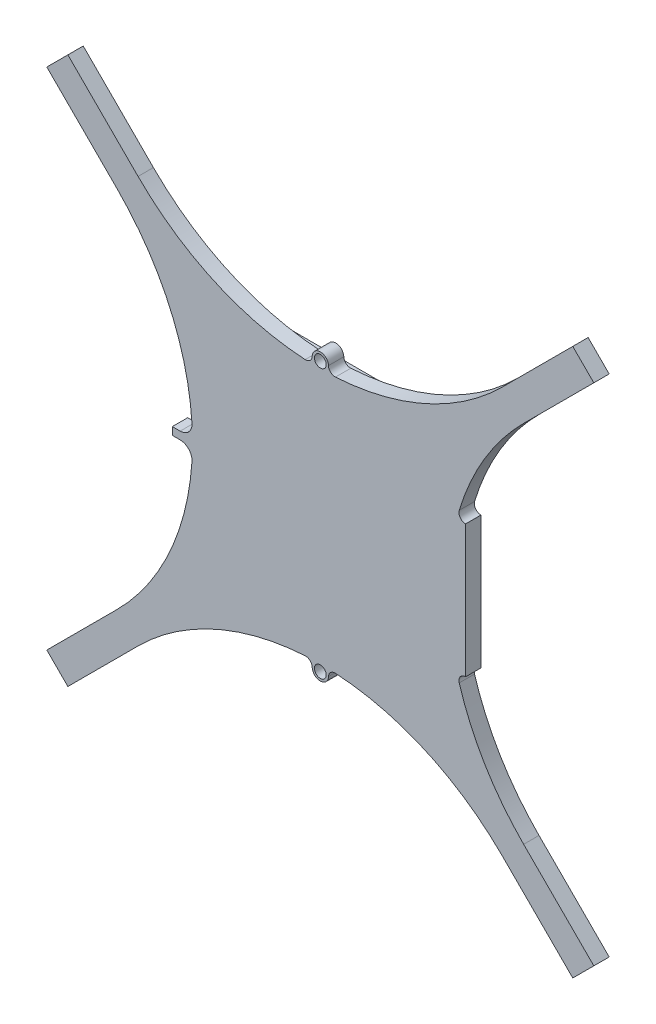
ISO-10303-21;
HEADER;
FILE_DESCRIPTION(('STEP AP214'),'2;1');
FILE_NAME('part.step','',(''),(''),'','','');
FILE_SCHEMA(('AUTOMOTIVE_DESIGN { 1 0 10303 214 1 1 1 1 }'));
ENDSEC;
DATA;
#1=APPLICATION_CONTEXT('core data for automotive mechanical design processes');
#2=APPLICATION_PROTOCOL_DEFINITION('international standard','automotive_design',2000,#1);
#3=PRODUCT_CONTEXT('',#1,'mechanical');
#4=PRODUCT('Part','Part','',(#3));
#5=PRODUCT_RELATED_PRODUCT_CATEGORY('part','',(#4));
#6=PRODUCT_DEFINITION_FORMATION('','',#4);
#7=PRODUCT_DEFINITION_CONTEXT('part definition',#1,'design');
#8=PRODUCT_DEFINITION('design','',#6,#7);
#9=PRODUCT_DEFINITION_SHAPE('','',#8);
#10=(LENGTH_UNIT() NAMED_UNIT(*) SI_UNIT(.MILLI.,.METRE.));
#11=(NAMED_UNIT(*) PLANE_ANGLE_UNIT() SI_UNIT($,.RADIAN.));
#12=(NAMED_UNIT(*) SI_UNIT($,.STERADIAN.) SOLID_ANGLE_UNIT());
#13=UNCERTAINTY_MEASURE_WITH_UNIT(LENGTH_MEASURE(1.E-05),#10,'distance_accuracy_value','');
#14=(GEOMETRIC_REPRESENTATION_CONTEXT(3) GLOBAL_UNCERTAINTY_ASSIGNED_CONTEXT((#13)) GLOBAL_UNIT_ASSIGNED_CONTEXT((#10,
#11,#12)) REPRESENTATION_CONTEXT('',''));
#15=CARTESIAN_POINT('',(0.,0.,0.));
#16=DIRECTION('',(0.,0.,1.));
#17=DIRECTION('',(1.,0.,0.));
#18=AXIS2_PLACEMENT_3D('',#15,#16,#17);
#19=CARTESIAN_POINT('',(0.,14.4490828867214,1.65));
#20=DIRECTION('',(0.,0.,1.));
#21=DIRECTION('',(1.,0.,0.));
#22=AXIS2_PLACEMENT_3D('',#19,#20,#21);
#23=PLANE('',#22);
#24=CARTESIAN_POINT('',(0.,14.4490828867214,1.65));
#25=DIRECTION('',(0.,0.,1.));
#26=DIRECTION('',(1.,0.,0.));
#27=AXIS2_PLACEMENT_3D('',#24,#25,#26);
#28=CIRCLE('',#27,0.634780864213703);
#29=CARTESIAN_POINT('',(0.634780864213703,14.4490828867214,1.65));
#30=VERTEX_POINT('',#29);
#31=EDGE_CURVE('E444',#30,#30,#28,.T.);
#32=ORIENTED_EDGE('',*,*,#31,.F.);
#33=EDGE_LOOP('',(#32));
#34=FACE_BOUND('',#33,.T.);
#35=CARTESIAN_POINT('',(0.,41.447379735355,1.65));
#36=DIRECTION('',(0.,0.,-1.));
#37=DIRECTION('',(1.,0.,0.));
#38=AXIS2_PLACEMENT_3D('',#35,#36,#37);
#39=CIRCLE('',#38,27.7077231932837);
#40=CARTESIAN_POINT('',(19.5923189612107,21.8550607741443,1.65));
#41=VERTEX_POINT('',#40);
#42=CARTESIAN_POINT('',(1.62722996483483,13.7874801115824,1.65));
#43=VERTEX_POINT('',#42);
#44=EDGE_CURVE('E512',#41,#43,#39,.T.);
#45=ORIENTED_EDGE('',*,*,#44,.T.);
#46=CARTESIAN_POINT('',(1.58546233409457,14.4974525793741,1.65));
#47=DIRECTION('',(0.,0.,1.));
#48=DIRECTION('',(1.,0.,0.));
#49=AXIS2_PLACEMENT_3D('',#46,#47,#48);
#50=CIRCLE('',#49,0.7112);
#51=CARTESIAN_POINT('',(0.874593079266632,14.4757651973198,1.65));
#52=VERTEX_POINT('',#51);
#53=EDGE_CURVE('E671',#43,#52,#50,.F.);
#54=ORIENTED_EDGE('',*,*,#53,.T.);
#55=CARTESIAN_POINT('',(0.,14.4490828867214,1.65));
#56=DIRECTION('',(0.,0.,1.));
#57=DIRECTION('',(1.,0.,0.));
#58=AXIS2_PLACEMENT_3D('',#55,#56,#57);
#59=CIRCLE('',#58,0.874999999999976);
#60=CARTESIAN_POINT('',(-0.874593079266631,14.4757651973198,1.65));
#61=VERTEX_POINT('',#60);
#62=EDGE_CURVE('E450',#52,#61,#59,.T.);
#63=ORIENTED_EDGE('',*,*,#62,.T.);
#64=CARTESIAN_POINT('',(-1.58546233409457,14.4974525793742,1.65));
#65=DIRECTION('',(0.,0.,1.));
#66=DIRECTION('',(1.,0.,0.));
#67=AXIS2_PLACEMENT_3D('',#64,#65,#66);
#68=CIRCLE('',#67,0.7112);
#69=CARTESIAN_POINT('',(-1.62722996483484,13.7874801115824,1.65));
#70=VERTEX_POINT('',#69);
#71=EDGE_CURVE('E667',#61,#70,#68,.F.);
#72=ORIENTED_EDGE('',*,*,#71,.T.);
#73=CARTESIAN_POINT('',(0.,41.447379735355,1.65));
#74=DIRECTION('',(0.,0.,-1.));
#75=DIRECTION('',(1.,0.,0.));
#76=AXIS2_PLACEMENT_3D('',#73,#74,#75);
#77=CIRCLE('',#76,27.7077231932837);
#78=CARTESIAN_POINT('',(-19.5923189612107,21.8550607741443,1.65));
#79=VERTEX_POINT('',#78);
#80=EDGE_CURVE('E453',#70,#79,#77,.T.);
#81=ORIENTED_EDGE('',*,*,#80,.T.);
#82=DIRECTION('',(-0.707106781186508,0.707106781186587,0.));
#83=VECTOR('',#82,1.);
#84=CARTESIAN_POINT('',(-19.5923189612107,21.8550607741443,1.65));
#85=LINE('',#84,#83);
#86=CARTESIAN_POINT('',(-27.1352227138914,29.3979645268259,1.65));
#87=VERTEX_POINT('',#86);
#88=EDGE_CURVE('E456',#79,#87,#85,.T.);
#89=ORIENTED_EDGE('',*,*,#88,.T.);
#90=DIRECTION('',(-0.707106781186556,-0.707106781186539,0.));
#91=VECTOR('',#90,1.);
#92=CARTESIAN_POINT('',(-27.1352227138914,29.3979645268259,1.65));
#93=LINE('',#92,#91);
#94=CARTESIAN_POINT('',(-29.3979645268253,27.135222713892,1.65));
#95=VERTEX_POINT('',#94);
#96=EDGE_CURVE('E458',#87,#95,#93,.T.);
#97=ORIENTED_EDGE('',*,*,#96,.T.);
#98=DIRECTION('',(0.707106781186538,-0.707106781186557,0.));
#99=VECTOR('',#98,1.);
#100=CARTESIAN_POINT('',(-21.8550607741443,19.5923189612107,1.65));
#101=LINE('',#100,#99);
#102=CARTESIAN_POINT('',(-21.8550607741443,19.5923189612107,1.65));
#103=VERTEX_POINT('',#102);
#104=EDGE_CURVE('E460',#95,#103,#101,.T.);
#105=ORIENTED_EDGE('',*,*,#104,.T.);
#106=CARTESIAN_POINT('',(-41.447379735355,0.,1.65));
#107=DIRECTION('',(0.,0.,-1.));
#108=DIRECTION('',(1.,0.,0.));
#109=AXIS2_PLACEMENT_3D('',#106,#107,#108);
#110=CIRCLE('',#109,27.7077231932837);
#111=CARTESIAN_POINT('',(-13.7957481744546,1.76215679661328,1.65));
#112=VERTEX_POINT('',#111);
#113=EDGE_CURVE('E462',#103,#112,#110,.T.);
#114=ORIENTED_EDGE('',*,*,#113,.T.);
#115=CARTESIAN_POINT('',(-15.0631771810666,1.68138729,1.65));
#116=DIRECTION('',(0.,0.,1.));
#117=DIRECTION('',(1.,0.,0.));
#118=AXIS2_PLACEMENT_3D('',#115,#116,#117);
#119=CIRCLE('',#118,1.27);
#120=CARTESIAN_POINT('',(-15.0631771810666,0.41138729,1.65));
#121=VERTEX_POINT('',#120);
#122=EDGE_CURVE('E11',#112,#121,#119,.F.);
#123=ORIENTED_EDGE('',*,*,#122,.T.);
#124=DIRECTION('',(-1.,0.,0.));
#125=VECTOR('',#124,1.);
#126=CARTESIAN_POINT('',(-15.908512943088,0.41138729,1.65));
#127=LINE('',#126,#125);
#128=CARTESIAN_POINT('',(-15.908512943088,0.41138729,1.65));
#129=VERTEX_POINT('',#128);
#130=EDGE_CURVE('E465',#121,#129,#127,.T.);
#131=ORIENTED_EDGE('',*,*,#130,.T.);
#132=DIRECTION('',(0.,-1.,0.));
#133=VECTOR('',#132,1.);
#134=CARTESIAN_POINT('',(-15.908512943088,-0.41138729,1.65));
#135=LINE('',#134,#133);
#136=CARTESIAN_POINT('',(-15.908512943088,-0.41138729,1.65));
#137=VERTEX_POINT('',#136);
#138=EDGE_CURVE('E467',#129,#137,#135,.T.);
#139=ORIENTED_EDGE('',*,*,#138,.T.);
#140=DIRECTION('',(1.,0.,0.));
#141=VECTOR('',#140,1.);
#142=CARTESIAN_POINT('',(-15.908512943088,-0.41138729,1.65));
#143=LINE('',#142,#141);
#144=CARTESIAN_POINT('',(-15.0631771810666,-0.41138729,1.65));
#145=VERTEX_POINT('',#144);
#146=EDGE_CURVE('E469',#137,#145,#143,.T.);
#147=ORIENTED_EDGE('',*,*,#146,.T.);
#148=CARTESIAN_POINT('',(-15.0631771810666,-1.68138729,1.65));
#149=DIRECTION('',(0.,0.,1.));
#150=DIRECTION('',(1.,0.,0.));
#151=AXIS2_PLACEMENT_3D('',#148,#149,#150);
#152=CIRCLE('',#151,1.27);
#153=CARTESIAN_POINT('',(-13.7957481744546,-1.76215679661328,1.65));
#154=VERTEX_POINT('',#153);
#155=EDGE_CURVE('E703',#145,#154,#152,.F.);
#156=ORIENTED_EDGE('',*,*,#155,.T.);
#157=CARTESIAN_POINT('',(-41.447379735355,0.,1.65));
#158=DIRECTION('',(0.,0.,-1.));
#159=DIRECTION('',(1.,0.,0.));
#160=AXIS2_PLACEMENT_3D('',#157,#158,#159);
#161=CIRCLE('',#160,27.7077231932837);
#162=CARTESIAN_POINT('',(-21.8550607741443,-19.5923189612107,1.65));
#163=VERTEX_POINT('',#162);
#164=EDGE_CURVE('E472',#154,#163,#161,.T.);
#165=ORIENTED_EDGE('',*,*,#164,.T.);
#166=DIRECTION('',(-0.707106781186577,-0.707106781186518,0.));
#167=VECTOR('',#166,1.);
#168=CARTESIAN_POINT('',(-21.8550607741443,-19.5923189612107,1.65));
#169=LINE('',#168,#167);
#170=CARTESIAN_POINT('',(-29.3979645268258,-27.1352227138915,1.65));
#171=VERTEX_POINT('',#170);
#172=EDGE_CURVE('E474',#163,#171,#169,.T.);
#173=ORIENTED_EDGE('',*,*,#172,.T.);
#174=DIRECTION('',(0.707106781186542,-0.707106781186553,0.));
#175=VECTOR('',#174,1.);
#176=CARTESIAN_POINT('',(-29.3979645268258,-27.1352227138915,1.65));
#177=LINE('',#176,#175);
#178=CARTESIAN_POINT('',(-27.1352227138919,-29.3979645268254,1.65));
#179=VERTEX_POINT('',#178);
#180=EDGE_CURVE('E476',#171,#179,#177,.T.);
#181=ORIENTED_EDGE('',*,*,#180,.T.);
#182=DIRECTION('',(0.707106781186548,0.707106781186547,0.));
#183=VECTOR('',#182,1.);
#184=CARTESIAN_POINT('',(-19.5923189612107,-21.8550607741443,1.65));
#185=LINE('',#184,#183);
#186=CARTESIAN_POINT('',(-19.5923189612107,-21.8550607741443,1.65));
#187=VERTEX_POINT('',#186);
#188=EDGE_CURVE('E478',#179,#187,#185,.T.);
#189=ORIENTED_EDGE('',*,*,#188,.T.);
#190=CARTESIAN_POINT('',(0.,-41.447379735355,1.65));
#191=DIRECTION('',(0.,0.,-1.));
#192=DIRECTION('',(1.,0.,0.));
#193=AXIS2_PLACEMENT_3D('',#190,#191,#192);
#194=CIRCLE('',#193,27.7077231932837);
#195=CARTESIAN_POINT('',(-1.62722996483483,-13.7874801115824,1.65));
#196=VERTEX_POINT('',#195);
#197=EDGE_CURVE('E480',#187,#196,#194,.T.);
#198=ORIENTED_EDGE('',*,*,#197,.T.);
#199=CARTESIAN_POINT('',(-1.58546233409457,-14.4974525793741,1.65));
#200=DIRECTION('',(0.,0.,1.));
#201=DIRECTION('',(1.,0.,0.));
#202=AXIS2_PLACEMENT_3D('',#199,#200,#201);
#203=CIRCLE('',#202,0.7112);
#204=CARTESIAN_POINT('',(-0.874593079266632,-14.4757651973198,1.65));
#205=VERTEX_POINT('',#204);
#206=EDGE_CURVE('E659',#196,#205,#203,.F.);
#207=ORIENTED_EDGE('',*,*,#206,.T.);
#208=CARTESIAN_POINT('',(0.,-14.4490828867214,1.65));
#209=DIRECTION('',(0.,0.,1.));
#210=DIRECTION('',(-1.,0.,0.));
#211=AXIS2_PLACEMENT_3D('',#208,#209,#210);
#212=CIRCLE('',#211,0.874999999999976);
#213=CARTESIAN_POINT('',(0.874593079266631,-14.4757651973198,1.65));
#214=VERTEX_POINT('',#213);
#215=EDGE_CURVE('E483',#205,#214,#212,.T.);
#216=ORIENTED_EDGE('',*,*,#215,.T.);
#217=CARTESIAN_POINT('',(1.58546233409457,-14.4974525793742,1.65));
#218=DIRECTION('',(0.,0.,1.));
#219=DIRECTION('',(1.,0.,0.));
#220=AXIS2_PLACEMENT_3D('',#217,#218,#219);
#221=CIRCLE('',#220,0.7112);
#222=CARTESIAN_POINT('',(1.62722996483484,-13.7874801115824,1.65));
#223=VERTEX_POINT('',#222);
#224=EDGE_CURVE('E663',#214,#223,#221,.F.);
#225=ORIENTED_EDGE('',*,*,#224,.T.);
#226=CARTESIAN_POINT('',(0.,-41.447379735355,1.65));
#227=DIRECTION('',(0.,0.,-1.));
#228=DIRECTION('',(1.,0.,0.));
#229=AXIS2_PLACEMENT_3D('',#226,#227,#228);
#230=CIRCLE('',#229,27.7077231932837);
#231=CARTESIAN_POINT('',(19.5923189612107,-21.8550607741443,1.65));
#232=VERTEX_POINT('',#231);
#233=EDGE_CURVE('E486',#223,#232,#230,.T.);
#234=ORIENTED_EDGE('',*,*,#233,.T.);
#235=DIRECTION('',(0.70710678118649,-0.707106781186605,0.));
#236=VECTOR('',#235,1.);
#237=CARTESIAN_POINT('',(19.5923189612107,-21.8550607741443,1.65));
#238=LINE('',#237,#236);
#239=CARTESIAN_POINT('',(27.1352227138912,-29.3979645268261,1.65));
#240=VERTEX_POINT('',#239);
#241=EDGE_CURVE('E488',#232,#240,#238,.T.);
#242=ORIENTED_EDGE('',*,*,#241,.T.);
#243=DIRECTION('',(0.707106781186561,0.707106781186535,0.));
#244=VECTOR('',#243,1.);
#245=CARTESIAN_POINT('',(27.1352227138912,-29.3979645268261,1.65));
#246=LINE('',#245,#244);
#247=CARTESIAN_POINT('',(29.3979645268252,-27.1352227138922,1.65));
#248=VERTEX_POINT('',#247);
#249=EDGE_CURVE('E490',#240,#248,#246,.T.);
#250=ORIENTED_EDGE('',*,*,#249,.T.);
#251=DIRECTION('',(-0.707106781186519,0.707106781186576,0.));
#252=VECTOR('',#251,1.);
#253=CARTESIAN_POINT('',(21.8550607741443,-19.5923189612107,1.65));
#254=LINE('',#253,#252);
#255=CARTESIAN_POINT('',(21.8550607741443,-19.5923189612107,1.65));
#256=VERTEX_POINT('',#255);
#257=EDGE_CURVE('E492',#248,#256,#254,.T.);
#258=ORIENTED_EDGE('',*,*,#257,.T.);
#259=CARTESIAN_POINT('',(41.447379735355,0.,1.65));
#260=DIRECTION('',(0.,0.,-1.));
#261=DIRECTION('',(1.,0.,0.));
#262=AXIS2_PLACEMENT_3D('',#259,#260,#261);
#263=CIRCLE('',#262,27.7077231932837);
#264=CARTESIAN_POINT('',(14.9294822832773,-8.03237444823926,1.65));
#265=VERTEX_POINT('',#264);
#266=EDGE_CURVE('E494',#256,#265,#263,.T.);
#267=ORIENTED_EDGE('',*,*,#266,.T.);
#268=CARTESIAN_POINT('',(15.6101419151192,-7.826199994,1.65));
#269=DIRECTION('',(0.,0.,1.));
#270=DIRECTION('',(1.,0.,0.));
#271=AXIS2_PLACEMENT_3D('',#268,#269,#270);
#272=CIRCLE('',#271,0.7112);
#273=CARTESIAN_POINT('',(15.6101419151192,-7.114999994,1.65));
#274=VERTEX_POINT('',#273);
#275=EDGE_CURVE('E685',#265,#274,#272,.F.);
#276=ORIENTED_EDGE('',*,*,#275,.T.);
#277=DIRECTION('',(1.,0.,0.));
#278=VECTOR('',#277,1.);
#279=CARTESIAN_POINT('',(15.618947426,-7.114999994,1.65));
#280=LINE('',#279,#278);
#281=CARTESIAN_POINT('',(15.618947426,-7.114999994,1.65));
#282=VERTEX_POINT('',#281);
#283=EDGE_CURVE('E497',#274,#282,#280,.T.);
#284=ORIENTED_EDGE('',*,*,#283,.T.);
#285=DIRECTION('',(0.,1.,0.));
#286=VECTOR('',#285,1.);
#287=CARTESIAN_POINT('',(15.618947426,7.114999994,1.65));
#288=LINE('',#287,#286);
#289=CARTESIAN_POINT('',(15.618947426,7.114999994,1.65));
#290=VERTEX_POINT('',#289);
#291=EDGE_CURVE('E499',#282,#290,#288,.T.);
#292=ORIENTED_EDGE('',*,*,#291,.T.);
#293=DIRECTION('',(-1.,0.,0.));
#294=VECTOR('',#293,1.);
#295=CARTESIAN_POINT('',(15.618947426,7.114999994,1.65));
#296=LINE('',#295,#294);
#297=CARTESIAN_POINT('',(15.6101419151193,7.114999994,1.65));
#298=VERTEX_POINT('',#297);
#299=EDGE_CURVE('E501',#290,#298,#296,.T.);
#300=ORIENTED_EDGE('',*,*,#299,.T.);
#301=CARTESIAN_POINT('',(15.6101419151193,7.826199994,1.65));
#302=DIRECTION('',(0.,0.,1.));
#303=DIRECTION('',(1.,0.,0.));
#304=AXIS2_PLACEMENT_3D('',#301,#302,#303);
#305=CIRCLE('',#304,0.7112);
#306=CARTESIAN_POINT('',(14.9294822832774,8.03237444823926,1.65));
#307=VERTEX_POINT('',#306);
#308=EDGE_CURVE('E689',#298,#307,#305,.F.);
#309=ORIENTED_EDGE('',*,*,#308,.T.);
#310=CARTESIAN_POINT('',(41.447379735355,0.,1.65));
#311=DIRECTION('',(0.,0.,-1.));
#312=DIRECTION('',(1.,0.,0.));
#313=AXIS2_PLACEMENT_3D('',#310,#311,#312);
#314=CIRCLE('',#313,27.7077231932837);
#315=CARTESIAN_POINT('',(21.8550607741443,19.5923189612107,1.65));
#316=VERTEX_POINT('',#315);
#317=EDGE_CURVE('E504',#307,#316,#314,.T.);
#318=ORIENTED_EDGE('',*,*,#317,.T.);
#319=DIRECTION('',(0.707106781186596,0.707106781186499,0.));
#320=VECTOR('',#319,1.);
#321=CARTESIAN_POINT('',(21.8550607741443,19.5923189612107,1.65));
#322=LINE('',#321,#320);
#323=CARTESIAN_POINT('',(29.397964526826,27.1352227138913,1.65));
#324=VERTEX_POINT('',#323);
#325=EDGE_CURVE('E506',#316,#324,#322,.T.);
#326=ORIENTED_EDGE('',*,*,#325,.T.);
#327=DIRECTION('',(-0.707106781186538,0.707106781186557,0.));
#328=VECTOR('',#327,1.);
#329=CARTESIAN_POINT('',(29.397964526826,27.1352227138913,1.65));
#330=LINE('',#329,#328);
#331=CARTESIAN_POINT('',(27.1352227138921,29.3979645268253,1.65));
#332=VERTEX_POINT('',#331);
#333=EDGE_CURVE('E508',#324,#332,#330,.T.);
#334=ORIENTED_EDGE('',*,*,#333,.T.);
#335=DIRECTION('',(-0.707106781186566,-0.707106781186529,0.));
#336=VECTOR('',#335,1.);
#337=CARTESIAN_POINT('',(19.5923189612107,21.8550607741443,1.65));
#338=LINE('',#337,#336);
#339=EDGE_CURVE('E510',#332,#41,#338,.T.);
#340=ORIENTED_EDGE('',*,*,#339,.T.);
#341=EDGE_LOOP('',(#45,#54,#63,#72,#81,#89,#97,#105,#114,#123,#131,#139,#147,#156,#165,#173,
#181,#189,#198,#207,#216,#225,#234,#242,#250,#258,#267,#276,#284,#292,#300,#309,#318,#326,#334,#340));
#342=FACE_BOUND('',#341,.T.);
#343=CARTESIAN_POINT('',(0.,-14.4490828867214,1.65));
#344=DIRECTION('',(0.,0.,1.));
#345=DIRECTION('',(-1.,0.,0.));
#346=AXIS2_PLACEMENT_3D('',#343,#344,#345);
#347=CIRCLE('',#346,0.634780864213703);
#348=CARTESIAN_POINT('',(-0.634780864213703,-14.4490828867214,1.65));
#349=VERTEX_POINT('',#348);
#350=EDGE_CURVE('E438',#349,#349,#347,.T.);
#351=ORIENTED_EDGE('',*,*,#350,.F.);
#352=EDGE_LOOP('',(#351));
#353=FACE_BOUND('',#352,.T.);
#354=ADVANCED_FACE('F37',(#34,#342,#353),#23,.T.);
#355=CARTESIAN_POINT('',(0.,14.4490828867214,0.));
#356=DIRECTION('',(0.,0.,1.));
#357=DIRECTION('',(1.,0.,0.));
#358=AXIS2_PLACEMENT_3D('',#355,#356,#357);
#359=PLANE('',#358);
#360=DIRECTION('',(0.,-1.,0.));
#361=VECTOR('',#360,1.);
#362=CARTESIAN_POINT('',(11.5,-11.542,0.));
#363=LINE('',#362,#361);
#364=CARTESIAN_POINT('',(11.5,-9.228,0.));
#365=VERTEX_POINT('',#364);
#366=CARTESIAN_POINT('',(11.5,-11.542,0.));
#367=VERTEX_POINT('',#366);
#368=EDGE_CURVE('E338',#365,#367,#363,.T.);
#369=ORIENTED_EDGE('',*,*,#368,.F.);
#370=DIRECTION('',(1.,0.,0.));
#371=VECTOR('',#370,1.);
#372=CARTESIAN_POINT('',(-11.5,-9.228,0.));
#373=LINE('',#372,#371);
#374=CARTESIAN_POINT('',(-11.5,-9.228,0.));
#375=VERTEX_POINT('',#374);
#376=EDGE_CURVE('E335',#375,#365,#373,.T.);
#377=ORIENTED_EDGE('',*,*,#376,.F.);
#378=DIRECTION('',(0.,1.,0.));
#379=VECTOR('',#378,1.);
#380=CARTESIAN_POINT('',(-11.5,-9.228,0.));
#381=LINE('',#380,#379);
#382=CARTESIAN_POINT('',(-11.5,-11.542,0.));
#383=VERTEX_POINT('',#382);
#384=EDGE_CURVE('E57',#383,#375,#381,.T.);
#385=ORIENTED_EDGE('',*,*,#384,.F.);
#386=DIRECTION('',(-1.,0.,0.));
#387=VECTOR('',#386,1.);
#388=CARTESIAN_POINT('',(-11.5,-11.542,0.));
#389=LINE('',#388,#387);
#390=EDGE_CURVE('E52',#367,#383,#389,.T.);
#391=ORIENTED_EDGE('',*,*,#390,.F.);
#392=EDGE_LOOP('',(#369,#377,#385,#391));
#393=FACE_BOUND('',#392,.T.);
#394=DIRECTION('',(0.,1.,0.));
#395=VECTOR('',#394,1.);
#396=CARTESIAN_POINT('',(-11.5,9.228,0.));
#397=LINE('',#396,#395);
#398=CARTESIAN_POINT('',(-11.5,9.228,0.));
#399=VERTEX_POINT('',#398);
#400=CARTESIAN_POINT('',(-11.5,11.542,0.));
#401=VERTEX_POINT('',#400);
#402=EDGE_CURVE('E402',#399,#401,#397,.T.);
#403=ORIENTED_EDGE('',*,*,#402,.F.);
#404=DIRECTION('',(-1.,0.,0.));
#405=VECTOR('',#404,1.);
#406=CARTESIAN_POINT('',(-11.5,9.228,0.));
#407=LINE('',#406,#405);
#408=CARTESIAN_POINT('',(11.5,9.228,0.));
#409=VERTEX_POINT('',#408);
#410=EDGE_CURVE('E409',#409,#399,#407,.T.);
#411=ORIENTED_EDGE('',*,*,#410,.F.);
#412=DIRECTION('',(0.,-1.,0.));
#413=VECTOR('',#412,1.);
#414=CARTESIAN_POINT('',(11.5,11.542,0.));
#415=LINE('',#414,#413);
#416=CARTESIAN_POINT('',(11.5,11.542,0.));
#417=VERTEX_POINT('',#416);
#418=EDGE_CURVE('E421',#417,#409,#415,.T.);
#419=ORIENTED_EDGE('',*,*,#418,.F.);
#420=DIRECTION('',(1.,0.,0.));
#421=VECTOR('',#420,1.);
#422=CARTESIAN_POINT('',(-11.5,11.542,0.));
#423=LINE('',#422,#421);
#424=EDGE_CURVE('E418',#401,#417,#423,.T.);
#425=ORIENTED_EDGE('',*,*,#424,.F.);
#426=EDGE_LOOP('',(#403,#411,#419,#425));
#427=FACE_BOUND('',#426,.T.);
#428=CARTESIAN_POINT('',(0.,14.4490828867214,0.));
#429=DIRECTION('',(0.,0.,1.));
#430=DIRECTION('',(1.,0.,0.));
#431=AXIS2_PLACEMENT_3D('',#428,#429,#430);
#432=CIRCLE('',#431,0.634780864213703);
#433=CARTESIAN_POINT('',(0.634780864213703,14.4490828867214,0.));
#434=VERTEX_POINT('',#433);
#435=EDGE_CURVE('E441',#434,#434,#432,.T.);
#436=ORIENTED_EDGE('',*,*,#435,.T.);
#437=EDGE_LOOP('',(#436));
#438=FACE_BOUND('',#437,.T.);
#439=CARTESIAN_POINT('',(0.,14.4490828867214,0.));
#440=DIRECTION('',(0.,0.,1.));
#441=DIRECTION('',(1.,0.,0.));
#442=AXIS2_PLACEMENT_3D('',#439,#440,#441);
#443=CIRCLE('',#442,0.874999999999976);
#444=CARTESIAN_POINT('',(0.874593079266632,14.4757651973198,0.));
#445=VERTEX_POINT('',#444);
#446=CARTESIAN_POINT('',(-0.874593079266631,14.4757651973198,0.));
#447=VERTEX_POINT('',#446);
#448=EDGE_CURVE('E447',#445,#447,#443,.T.);
#449=ORIENTED_EDGE('',*,*,#448,.F.);
#450=CARTESIAN_POINT('',(1.58546233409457,14.4974525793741,0.));
#451=DIRECTION('',(0.,0.,1.));
#452=DIRECTION('',(1.,0.,0.));
#453=AXIS2_PLACEMENT_3D('',#450,#451,#452);
#454=CIRCLE('',#453,0.7112);
#455=CARTESIAN_POINT('',(1.62722996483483,13.7874801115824,0.));
#456=VERTEX_POINT('',#455);
#457=EDGE_CURVE('E669',#445,#456,#454,.T.);
#458=ORIENTED_EDGE('',*,*,#457,.T.);
#459=CARTESIAN_POINT('',(0.,41.447379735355,0.));
#460=DIRECTION('',(0.,0.,-1.));
#461=DIRECTION('',(1.,0.,0.));
#462=AXIS2_PLACEMENT_3D('',#459,#460,#461);
#463=CIRCLE('',#462,27.7077231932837);
#464=CARTESIAN_POINT('',(19.5923189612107,21.8550607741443,0.));
#465=VERTEX_POINT('',#464);
#466=EDGE_CURVE('E454',#465,#456,#463,.T.);
#467=ORIENTED_EDGE('',*,*,#466,.F.);
#468=DIRECTION('',(-0.707106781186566,-0.707106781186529,0.));
#469=VECTOR('',#468,1.);
#470=CARTESIAN_POINT('',(19.5923189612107,21.8550607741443,0.));
#471=LINE('',#470,#469);
#472=CARTESIAN_POINT('',(27.1352227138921,29.3979645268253,0.));
#473=VERTEX_POINT('',#472);
#474=EDGE_CURVE('E574',#473,#465,#471,.T.);
#475=ORIENTED_EDGE('',*,*,#474,.F.);
#476=DIRECTION('',(-0.707106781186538,0.707106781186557,0.));
#477=VECTOR('',#476,1.);
#478=CARTESIAN_POINT('',(29.397964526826,27.1352227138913,0.));
#479=LINE('',#478,#477);
#480=CARTESIAN_POINT('',(29.397964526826,27.1352227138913,0.));
#481=VERTEX_POINT('',#480);
#482=EDGE_CURVE('E572',#481,#473,#479,.T.);
#483=ORIENTED_EDGE('',*,*,#482,.F.);
#484=DIRECTION('',(0.707106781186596,0.707106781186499,0.));
#485=VECTOR('',#484,1.);
#486=CARTESIAN_POINT('',(21.8550607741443,19.5923189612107,0.));
#487=LINE('',#486,#485);
#488=CARTESIAN_POINT('',(21.8550607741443,19.5923189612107,0.));
#489=VERTEX_POINT('',#488);
#490=EDGE_CURVE('E570',#489,#481,#487,.T.);
#491=ORIENTED_EDGE('',*,*,#490,.F.);
#492=CARTESIAN_POINT('',(41.447379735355,0.,0.));
#493=DIRECTION('',(0.,0.,-1.));
#494=DIRECTION('',(1.,0.,0.));
#495=AXIS2_PLACEMENT_3D('',#492,#493,#494);
#496=CIRCLE('',#495,27.7077231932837);
#497=CARTESIAN_POINT('',(14.9294822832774,8.03237444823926,0.));
#498=VERTEX_POINT('',#497);
#499=EDGE_CURVE('E568',#498,#489,#496,.T.);
#500=ORIENTED_EDGE('',*,*,#499,.F.);
#501=CARTESIAN_POINT('',(15.6101419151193,7.826199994,0.));
#502=DIRECTION('',(0.,0.,1.));
#503=DIRECTION('',(1.,0.,0.));
#504=AXIS2_PLACEMENT_3D('',#501,#502,#503);
#505=CIRCLE('',#504,0.7112);
#506=CARTESIAN_POINT('',(15.6101419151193,7.114999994,0.));
#507=VERTEX_POINT('',#506);
#508=EDGE_CURVE('E687',#498,#507,#505,.T.);
#509=ORIENTED_EDGE('',*,*,#508,.T.);
#510=DIRECTION('',(-1.,0.,0.));
#511=VECTOR('',#510,1.);
#512=CARTESIAN_POINT('',(15.618947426,7.114999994,0.));
#513=LINE('',#512,#511);
#514=CARTESIAN_POINT('',(15.618947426,7.114999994,0.));
#515=VERTEX_POINT('',#514);
#516=EDGE_CURVE('E565',#515,#507,#513,.T.);
#517=ORIENTED_EDGE('',*,*,#516,.F.);
#518=DIRECTION('',(0.,1.,0.));
#519=VECTOR('',#518,1.);
#520=CARTESIAN_POINT('',(15.618947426,7.114999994,0.));
#521=LINE('',#520,#519);
#522=CARTESIAN_POINT('',(15.618947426,-7.114999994,0.));
#523=VERTEX_POINT('',#522);
#524=EDGE_CURVE('E563',#523,#515,#521,.T.);
#525=ORIENTED_EDGE('',*,*,#524,.F.);
#526=DIRECTION('',(1.,0.,0.));
#527=VECTOR('',#526,1.);
#528=CARTESIAN_POINT('',(15.618947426,-7.114999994,0.));
#529=LINE('',#528,#527);
#530=CARTESIAN_POINT('',(15.6101419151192,-7.114999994,0.));
#531=VERTEX_POINT('',#530);
#532=EDGE_CURVE('E561',#531,#523,#529,.T.);
#533=ORIENTED_EDGE('',*,*,#532,.F.);
#534=CARTESIAN_POINT('',(15.6101419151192,-7.826199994,0.));
#535=DIRECTION('',(0.,0.,1.));
#536=DIRECTION('',(1.,0.,0.));
#537=AXIS2_PLACEMENT_3D('',#534,#535,#536);
#538=CIRCLE('',#537,0.7112);
#539=CARTESIAN_POINT('',(14.9294822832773,-8.03237444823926,0.));
#540=VERTEX_POINT('',#539);
#541=EDGE_CURVE('E683',#531,#540,#538,.T.);
#542=ORIENTED_EDGE('',*,*,#541,.T.);
#543=CARTESIAN_POINT('',(41.447379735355,0.,0.));
#544=DIRECTION('',(0.,0.,-1.));
#545=DIRECTION('',(1.,0.,0.));
#546=AXIS2_PLACEMENT_3D('',#543,#544,#545);
#547=CIRCLE('',#546,27.7077231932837);
#548=CARTESIAN_POINT('',(21.8550607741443,-19.5923189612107,0.));
#549=VERTEX_POINT('',#548);
#550=EDGE_CURVE('E558',#549,#540,#547,.T.);
#551=ORIENTED_EDGE('',*,*,#550,.F.);
#552=DIRECTION('',(-0.707106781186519,0.707106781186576,0.));
#553=VECTOR('',#552,1.);
#554=CARTESIAN_POINT('',(21.8550607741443,-19.5923189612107,0.));
#555=LINE('',#554,#553);
#556=CARTESIAN_POINT('',(29.3979645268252,-27.1352227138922,0.));
#557=VERTEX_POINT('',#556);
#558=EDGE_CURVE('E556',#557,#549,#555,.T.);
#559=ORIENTED_EDGE('',*,*,#558,.F.);
#560=DIRECTION('',(0.707106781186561,0.707106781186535,0.));
#561=VECTOR('',#560,1.);
#562=CARTESIAN_POINT('',(27.1352227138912,-29.3979645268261,0.));
#563=LINE('',#562,#561);
#564=CARTESIAN_POINT('',(27.1352227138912,-29.3979645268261,0.));
#565=VERTEX_POINT('',#564);
#566=EDGE_CURVE('E554',#565,#557,#563,.T.);
#567=ORIENTED_EDGE('',*,*,#566,.F.);
#568=DIRECTION('',(0.70710678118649,-0.707106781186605,0.));
#569=VECTOR('',#568,1.);
#570=CARTESIAN_POINT('',(19.5923189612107,-21.8550607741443,0.));
#571=LINE('',#570,#569);
#572=CARTESIAN_POINT('',(19.5923189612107,-21.8550607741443,0.));
#573=VERTEX_POINT('',#572);
#574=EDGE_CURVE('E552',#573,#565,#571,.T.);
#575=ORIENTED_EDGE('',*,*,#574,.F.);
#576=CARTESIAN_POINT('',(0.,-41.447379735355,0.));
#577=DIRECTION('',(0.,0.,-1.));
#578=DIRECTION('',(1.,0.,0.));
#579=AXIS2_PLACEMENT_3D('',#576,#577,#578);
#580=CIRCLE('',#579,27.7077231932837);
#581=CARTESIAN_POINT('',(1.62722996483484,-13.7874801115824,0.));
#582=VERTEX_POINT('',#581);
#583=EDGE_CURVE('E550',#582,#573,#580,.T.);
#584=ORIENTED_EDGE('',*,*,#583,.F.);
#585=CARTESIAN_POINT('',(1.58546233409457,-14.4974525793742,0.));
#586=DIRECTION('',(0.,0.,1.));
#587=DIRECTION('',(1.,0.,0.));
#588=AXIS2_PLACEMENT_3D('',#585,#586,#587);
#589=CIRCLE('',#588,0.7112);
#590=CARTESIAN_POINT('',(0.874593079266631,-14.4757651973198,0.));
#591=VERTEX_POINT('',#590);
#592=EDGE_CURVE('E661',#582,#591,#589,.T.);
#593=ORIENTED_EDGE('',*,*,#592,.T.);
#594=CARTESIAN_POINT('',(0.,-14.4490828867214,0.));
#595=DIRECTION('',(0.,0.,1.));
#596=DIRECTION('',(-1.,0.,0.));
#597=AXIS2_PLACEMENT_3D('',#594,#595,#596);
#598=CIRCLE('',#597,0.874999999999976);
#599=CARTESIAN_POINT('',(-0.874593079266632,-14.4757651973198,0.));
#600=VERTEX_POINT('',#599);
#601=EDGE_CURVE('E547',#600,#591,#598,.T.);
#602=ORIENTED_EDGE('',*,*,#601,.F.);
#603=CARTESIAN_POINT('',(-1.58546233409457,-14.4974525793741,0.));
#604=DIRECTION('',(0.,0.,1.));
#605=DIRECTION('',(1.,0.,0.));
#606=AXIS2_PLACEMENT_3D('',#603,#604,#605);
#607=CIRCLE('',#606,0.7112);
#608=CARTESIAN_POINT('',(-1.62722996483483,-13.7874801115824,0.));
#609=VERTEX_POINT('',#608);
#610=EDGE_CURVE('E657',#600,#609,#607,.T.);
#611=ORIENTED_EDGE('',*,*,#610,.T.);
#612=CARTESIAN_POINT('',(0.,-41.447379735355,0.));
#613=DIRECTION('',(0.,0.,-1.));
#614=DIRECTION('',(1.,0.,0.));
#615=AXIS2_PLACEMENT_3D('',#612,#613,#614);
#616=CIRCLE('',#615,27.7077231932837);
#617=CARTESIAN_POINT('',(-19.5923189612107,-21.8550607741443,0.));
#618=VERTEX_POINT('',#617);
#619=EDGE_CURVE('E544',#618,#609,#616,.T.);
#620=ORIENTED_EDGE('',*,*,#619,.F.);
#621=DIRECTION('',(0.707106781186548,0.707106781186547,0.));
#622=VECTOR('',#621,1.);
#623=CARTESIAN_POINT('',(-19.5923189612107,-21.8550607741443,0.));
#624=LINE('',#623,#622);
#625=CARTESIAN_POINT('',(-27.1352227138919,-29.3979645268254,0.));
#626=VERTEX_POINT('',#625);
#627=EDGE_CURVE('E542',#626,#618,#624,.T.);
#628=ORIENTED_EDGE('',*,*,#627,.F.);
#629=DIRECTION('',(0.707106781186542,-0.707106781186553,0.));
#630=VECTOR('',#629,1.);
#631=CARTESIAN_POINT('',(-29.3979645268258,-27.1352227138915,0.));
#632=LINE('',#631,#630);
#633=CARTESIAN_POINT('',(-29.3979645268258,-27.1352227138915,0.));
#634=VERTEX_POINT('',#633);
#635=EDGE_CURVE('E540',#634,#626,#632,.T.);
#636=ORIENTED_EDGE('',*,*,#635,.F.);
#637=DIRECTION('',(-0.707106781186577,-0.707106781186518,0.));
#638=VECTOR('',#637,1.);
#639=CARTESIAN_POINT('',(-21.8550607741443,-19.5923189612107,0.));
#640=LINE('',#639,#638);
#641=CARTESIAN_POINT('',(-21.8550607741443,-19.5923189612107,0.));
#642=VERTEX_POINT('',#641);
#643=EDGE_CURVE('E538',#642,#634,#640,.T.);
#644=ORIENTED_EDGE('',*,*,#643,.F.);
#645=CARTESIAN_POINT('',(-41.447379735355,0.,0.));
#646=DIRECTION('',(0.,0.,-1.));
#647=DIRECTION('',(1.,0.,0.));
#648=AXIS2_PLACEMENT_3D('',#645,#646,#647);
#649=CIRCLE('',#648,27.7077231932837);
#650=CARTESIAN_POINT('',(-13.7957481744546,-1.76215679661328,0.));
#651=VERTEX_POINT('',#650);
#652=EDGE_CURVE('E536',#651,#642,#649,.T.);
#653=ORIENTED_EDGE('',*,*,#652,.F.);
#654=CARTESIAN_POINT('',(-15.0631771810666,-1.68138729,0.));
#655=DIRECTION('',(0.,0.,1.));
#656=DIRECTION('',(1.,0.,0.));
#657=AXIS2_PLACEMENT_3D('',#654,#655,#656);
#658=CIRCLE('',#657,1.27);
#659=CARTESIAN_POINT('',(-15.0631771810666,-0.41138729,0.));
#660=VERTEX_POINT('',#659);
#661=EDGE_CURVE('E701',#651,#660,#658,.T.);
#662=ORIENTED_EDGE('',*,*,#661,.T.);
#663=DIRECTION('',(1.,0.,0.));
#664=VECTOR('',#663,1.);
#665=CARTESIAN_POINT('',(-15.908512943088,-0.41138729,0.));
#666=LINE('',#665,#664);
#667=CARTESIAN_POINT('',(-15.908512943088,-0.41138729,0.));
#668=VERTEX_POINT('',#667);
#669=EDGE_CURVE('E533',#668,#660,#666,.T.);
#670=ORIENTED_EDGE('',*,*,#669,.F.);
#671=DIRECTION('',(0.,-1.,0.));
#672=VECTOR('',#671,1.);
#673=CARTESIAN_POINT('',(-15.908512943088,-0.41138729,0.));
#674=LINE('',#673,#672);
#675=CARTESIAN_POINT('',(-15.908512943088,0.41138729,0.));
#676=VERTEX_POINT('',#675);
#677=EDGE_CURVE('E531',#676,#668,#674,.T.);
#678=ORIENTED_EDGE('',*,*,#677,.F.);
#679=DIRECTION('',(-1.,0.,0.));
#680=VECTOR('',#679,1.);
#681=CARTESIAN_POINT('',(-15.908512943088,0.41138729,0.));
#682=LINE('',#681,#680);
#683=CARTESIAN_POINT('',(-15.0631771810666,0.41138729,0.));
#684=VERTEX_POINT('',#683);
#685=EDGE_CURVE('E529',#684,#676,#682,.T.);
#686=ORIENTED_EDGE('',*,*,#685,.F.);
#687=CARTESIAN_POINT('',(-15.0631771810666,1.68138729,0.));
#688=DIRECTION('',(0.,0.,1.));
#689=DIRECTION('',(1.,0.,0.));
#690=AXIS2_PLACEMENT_3D('',#687,#688,#689);
#691=CIRCLE('',#690,1.27);
#692=CARTESIAN_POINT('',(-13.7957481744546,1.76215679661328,0.));
#693=VERTEX_POINT('',#692);
#694=EDGE_CURVE('E45',#684,#693,#691,.T.);
#695=ORIENTED_EDGE('',*,*,#694,.T.);
#696=CARTESIAN_POINT('',(-41.447379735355,0.,0.));
#697=DIRECTION('',(0.,0.,-1.));
#698=DIRECTION('',(1.,0.,0.));
#699=AXIS2_PLACEMENT_3D('',#696,#697,#698);
#700=CIRCLE('',#699,27.7077231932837);
#701=CARTESIAN_POINT('',(-21.8550607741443,19.5923189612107,0.));
#702=VERTEX_POINT('',#701);
#703=EDGE_CURVE('E526',#702,#693,#700,.T.);
#704=ORIENTED_EDGE('',*,*,#703,.F.);
#705=DIRECTION('',(0.707106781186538,-0.707106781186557,0.));
#706=VECTOR('',#705,1.);
#707=CARTESIAN_POINT('',(-21.8550607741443,19.5923189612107,0.));
#708=LINE('',#707,#706);
#709=CARTESIAN_POINT('',(-29.3979645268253,27.135222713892,0.));
#710=VERTEX_POINT('',#709);
#711=EDGE_CURVE('E524',#710,#702,#708,.T.);
#712=ORIENTED_EDGE('',*,*,#711,.F.);
#713=DIRECTION('',(-0.707106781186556,-0.707106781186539,0.));
#714=VECTOR('',#713,1.);
#715=CARTESIAN_POINT('',(-27.1352227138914,29.3979645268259,0.));
#716=LINE('',#715,#714);
#717=CARTESIAN_POINT('',(-27.1352227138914,29.3979645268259,0.));
#718=VERTEX_POINT('',#717);
#719=EDGE_CURVE('E522',#718,#710,#716,.T.);
#720=ORIENTED_EDGE('',*,*,#719,.F.);
#721=DIRECTION('',(-0.707106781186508,0.707106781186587,0.));
#722=VECTOR('',#721,1.);
#723=CARTESIAN_POINT('',(-19.5923189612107,21.8550607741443,0.));
#724=LINE('',#723,#722);
#725=CARTESIAN_POINT('',(-19.5923189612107,21.8550607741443,0.));
#726=VERTEX_POINT('',#725);
#727=EDGE_CURVE('E520',#726,#718,#724,.T.);
#728=ORIENTED_EDGE('',*,*,#727,.F.);
#729=CARTESIAN_POINT('',(0.,41.447379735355,0.));
#730=DIRECTION('',(0.,0.,-1.));
#731=DIRECTION('',(1.,0.,0.));
#732=AXIS2_PLACEMENT_3D('',#729,#730,#731);
#733=CIRCLE('',#732,27.7077231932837);
#734=CARTESIAN_POINT('',(-1.62722996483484,13.7874801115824,0.));
#735=VERTEX_POINT('',#734);
#736=EDGE_CURVE('E518',#735,#726,#733,.T.);
#737=ORIENTED_EDGE('',*,*,#736,.F.);
#738=CARTESIAN_POINT('',(-1.58546233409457,14.4974525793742,0.));
#739=DIRECTION('',(0.,0.,1.));
#740=DIRECTION('',(1.,0.,0.));
#741=AXIS2_PLACEMENT_3D('',#738,#739,#740);
#742=CIRCLE('',#741,0.7112);
#743=EDGE_CURVE('E665',#735,#447,#742,.T.);
#744=ORIENTED_EDGE('',*,*,#743,.T.);
#745=EDGE_LOOP('',(#449,#458,#467,#475,#483,#491,#500,#509,#517,#525,#533,#542,#551,#559,#567,
#575,#584,#593,#602,#611,#620,#628,#636,#644,#653,#662,#670,#678,#686,#695,#704,#712,#720,#728,
#737,#744));
#746=FACE_BOUND('',#745,.T.);
#747=CARTESIAN_POINT('',(0.,-14.4490828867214,0.));
#748=DIRECTION('',(0.,0.,1.));
#749=DIRECTION('',(-1.,0.,0.));
#750=AXIS2_PLACEMENT_3D('',#747,#748,#749);
#751=CIRCLE('',#750,0.634780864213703);
#752=CARTESIAN_POINT('',(-0.634780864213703,-14.4490828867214,0.));
#753=VERTEX_POINT('',#752);
#754=EDGE_CURVE('E437',#753,#753,#751,.T.);
#755=ORIENTED_EDGE('',*,*,#754,.T.);
#756=EDGE_LOOP('',(#755));
#757=FACE_BOUND('',#756,.T.);
#758=ADVANCED_FACE('F708',(#393,#427,#438,#746,#757),#359,.F.);
#759=CARTESIAN_POINT('',(0.,14.4490828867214,1.65));
#760=DIRECTION('',(0.,0.,-1.));
#761=DIRECTION('',(-1.,0.,0.));
#762=AXIS2_PLACEMENT_3D('',#759,#760,#761);
#763=CYLINDRICAL_SURFACE('',#762,0.874999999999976);
#764=ORIENTED_EDGE('',*,*,#448,.T.);
#765=DIRECTION('',(0.,0.,-1.));
#766=VECTOR('',#765,1.);
#767=CARTESIAN_POINT('',(-0.874593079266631,14.4757651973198,1.65));
#768=LINE('',#767,#766);
#769=EDGE_CURVE('E653',#447,#61,#768,.F.);
#770=ORIENTED_EDGE('',*,*,#769,.T.);
#771=ORIENTED_EDGE('',*,*,#62,.F.);
#772=DIRECTION('',(0.,0.,-1.));
#773=VECTOR('',#772,1.);
#774=CARTESIAN_POINT('',(0.874593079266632,14.4757651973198,1.65));
#775=LINE('',#774,#773);
#776=EDGE_CURVE('E650',#52,#445,#775,.T.);
#777=ORIENTED_EDGE('',*,*,#776,.T.);
#778=EDGE_LOOP('',(#764,#770,#771,#777));
#779=FACE_BOUND('',#778,.T.);
#780=ADVANCED_FACE('F856',(#779),#763,.T.);
#781=CARTESIAN_POINT('',(0.,41.447379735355,1.65));
#782=DIRECTION('',(0.,0.,-1.));
#783=DIRECTION('',(-1.,0.,0.));
#784=AXIS2_PLACEMENT_3D('',#781,#782,#783);
#785=CYLINDRICAL_SURFACE('',#784,27.7077231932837);
#786=ORIENTED_EDGE('',*,*,#80,.F.);
#787=DIRECTION('',(0.,0.,-1.));
#788=VECTOR('',#787,1.);
#789=CARTESIAN_POINT('',(-1.62722996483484,13.7874801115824,1.65));
#790=LINE('',#789,#788);
#791=EDGE_CURVE('E647',#70,#735,#790,.T.);
#792=ORIENTED_EDGE('',*,*,#791,.T.);
#793=ORIENTED_EDGE('',*,*,#736,.T.);
#794=DIRECTION('',(0.,0.,-1.));
#795=VECTOR('',#794,1.);
#796=CARTESIAN_POINT('',(-19.5923189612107,21.8550607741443,1.65));
#797=LINE('',#796,#795);
#798=EDGE_CURVE('E634',#79,#726,#797,.T.);
#799=ORIENTED_EDGE('',*,*,#798,.F.);
#800=EDGE_LOOP('',(#786,#792,#793,#799));
#801=FACE_BOUND('',#800,.T.);
#802=ADVANCED_FACE('F864',(#801),#785,.F.);
#803=CARTESIAN_POINT('',(-19.5923189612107,21.8550607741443,1.65));
#804=DIRECTION('',(-0.707106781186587,-0.707106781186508,0.));
#805=DIRECTION('',(0.707106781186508,-0.707106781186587,0.));
#806=AXIS2_PLACEMENT_3D('',#803,#804,#805);
#807=PLANE('',#806);
#808=ORIENTED_EDGE('',*,*,#727,.T.);
#809=DIRECTION('',(0.,0.,-1.));
#810=VECTOR('',#809,1.);
#811=CARTESIAN_POINT('',(-27.1352227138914,29.3979645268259,1.65));
#812=LINE('',#811,#810);
#813=EDGE_CURVE('E631',#87,#718,#812,.T.);
#814=ORIENTED_EDGE('',*,*,#813,.F.);
#815=ORIENTED_EDGE('',*,*,#88,.F.);
#816=ORIENTED_EDGE('',*,*,#798,.T.);
#817=EDGE_LOOP('',(#808,#814,#815,#816));
#818=FACE_BOUND('',#817,.T.);
#819=ADVANCED_FACE('F870',(#818),#807,.F.);
#820=CARTESIAN_POINT('',(-27.1352227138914,29.3979645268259,1.65));
#821=DIRECTION('',(0.707106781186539,-0.707106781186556,0.));
#822=DIRECTION('',(0.707106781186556,0.707106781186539,0.));
#823=AXIS2_PLACEMENT_3D('',#820,#821,#822);
#824=PLANE('',#823);
#825=ORIENTED_EDGE('',*,*,#719,.T.);
#826=DIRECTION('',(0.,0.,-1.));
#827=VECTOR('',#826,1.);
#828=CARTESIAN_POINT('',(-29.3979645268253,27.135222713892,1.65));
#829=LINE('',#828,#827);
#830=EDGE_CURVE('E628',#95,#710,#829,.T.);
#831=ORIENTED_EDGE('',*,*,#830,.F.);
#832=ORIENTED_EDGE('',*,*,#96,.F.);
#833=ORIENTED_EDGE('',*,*,#813,.T.);
#834=EDGE_LOOP('',(#825,#831,#832,#833));
#835=FACE_BOUND('',#834,.T.);
#836=ADVANCED_FACE('F875',(#835),#824,.F.);
#837=CARTESIAN_POINT('',(-21.8550607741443,19.5923189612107,1.65));
#838=DIRECTION('',(0.707106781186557,0.707106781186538,0.));
#839=DIRECTION('',(-0.707106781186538,0.707106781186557,0.));
#840=AXIS2_PLACEMENT_3D('',#837,#838,#839);
#841=PLANE('',#840);
#842=ORIENTED_EDGE('',*,*,#711,.T.);
#843=DIRECTION('',(0.,0.,-1.));
#844=VECTOR('',#843,1.);
#845=CARTESIAN_POINT('',(-21.8550607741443,19.5923189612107,1.65));
#846=LINE('',#845,#844);
#847=EDGE_CURVE('E625',#103,#702,#846,.T.);
#848=ORIENTED_EDGE('',*,*,#847,.F.);
#849=ORIENTED_EDGE('',*,*,#104,.F.);
#850=ORIENTED_EDGE('',*,*,#830,.T.);
#851=EDGE_LOOP('',(#842,#848,#849,#850));
#852=FACE_BOUND('',#851,.T.);
#853=ADVANCED_FACE('F878',(#852),#841,.F.);
#854=CARTESIAN_POINT('',(-41.447379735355,0.,1.65));
#855=DIRECTION('',(0.,0.,-1.));
#856=DIRECTION('',(-1.,0.,0.));
#857=AXIS2_PLACEMENT_3D('',#854,#855,#856);
#858=CYLINDRICAL_SURFACE('',#857,27.7077231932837);
#859=ORIENTED_EDGE('',*,*,#703,.T.);
#860=DIRECTION('',(0.,0.,-1.));
#861=VECTOR('',#860,1.);
#862=CARTESIAN_POINT('',(-13.7957481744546,1.76215679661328,1.65));
#863=LINE('',#862,#861);
#864=EDGE_CURVE('E699',#693,#112,#863,.F.);
#865=ORIENTED_EDGE('',*,*,#864,.T.);
#866=ORIENTED_EDGE('',*,*,#113,.F.);
#867=ORIENTED_EDGE('',*,*,#847,.T.);
#868=EDGE_LOOP('',(#859,#865,#866,#867));
#869=FACE_BOUND('',#868,.T.);
#870=ADVANCED_FACE('F716',(#869),#858,.F.);
#871=CARTESIAN_POINT('',(-15.908512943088,0.41138729,1.65));
#872=DIRECTION('',(0.,-1.,0.));
#873=DIRECTION('',(0.,0.,-1.));
#874=AXIS2_PLACEMENT_3D('',#871,#872,#873);
#875=PLANE('',#874);
#876=ORIENTED_EDGE('',*,*,#130,.F.);
#877=DIRECTION('',(0.,0.,1.));
#878=VECTOR('',#877,1.);
#879=CARTESIAN_POINT('',(-15.0631771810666,0.41138729,0.));
#880=LINE('',#879,#878);
#881=EDGE_CURVE('E696',#121,#684,#880,.F.);
#882=ORIENTED_EDGE('',*,*,#881,.T.);
#883=ORIENTED_EDGE('',*,*,#685,.T.);
#884=DIRECTION('',(0.,0.,-1.));
#885=VECTOR('',#884,1.);
#886=CARTESIAN_POINT('',(-15.908512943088,0.41138729,1.65));
#887=LINE('',#886,#885);
#888=EDGE_CURVE('E622',#129,#676,#887,.T.);
#889=ORIENTED_EDGE('',*,*,#888,.F.);
#890=EDGE_LOOP('',(#876,#882,#883,#889));
#891=FACE_BOUND('',#890,.T.);
#892=ADVANCED_FACE('F725',(#891),#875,.F.);
#893=CARTESIAN_POINT('',(-15.908512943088,-0.41138729,1.65));
#894=DIRECTION('',(1.,0.,0.));
#895=DIRECTION('',(0.,0.,-1.));
#896=AXIS2_PLACEMENT_3D('',#893,#894,#895);
#897=PLANE('',#896);
#898=ORIENTED_EDGE('',*,*,#677,.T.);
#899=DIRECTION('',(0.,0.,-1.));
#900=VECTOR('',#899,1.);
#901=CARTESIAN_POINT('',(-15.908512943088,-0.41138729,1.65));
#902=LINE('',#901,#900);
#903=EDGE_CURVE('E619',#137,#668,#902,.T.);
#904=ORIENTED_EDGE('',*,*,#903,.F.);
#905=ORIENTED_EDGE('',*,*,#138,.F.);
#906=ORIENTED_EDGE('',*,*,#888,.T.);
#907=EDGE_LOOP('',(#898,#904,#905,#906));
#908=FACE_BOUND('',#907,.T.);
#909=ADVANCED_FACE('F729',(#908),#897,.F.);
#910=CARTESIAN_POINT('',(-15.908512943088,-0.41138729,1.65));
#911=DIRECTION('',(0.,1.,0.));
#912=DIRECTION('',(0.,0.,1.));
#913=AXIS2_PLACEMENT_3D('',#910,#911,#912);
#914=PLANE('',#913);
#915=ORIENTED_EDGE('',*,*,#669,.T.);
#916=DIRECTION('',(0.,0.,1.));
#917=VECTOR('',#916,1.);
#918=CARTESIAN_POINT('',(-15.0631771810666,-0.41138729,1.65));
#919=LINE('',#918,#917);
#920=EDGE_CURVE('E694',#660,#145,#919,.T.);
#921=ORIENTED_EDGE('',*,*,#920,.T.);
#922=ORIENTED_EDGE('',*,*,#146,.F.);
#923=ORIENTED_EDGE('',*,*,#903,.T.);
#924=EDGE_LOOP('',(#915,#921,#922,#923));
#925=FACE_BOUND('',#924,.T.);
#926=ADVANCED_FACE('F940',(#925),#914,.F.);
#927=CARTESIAN_POINT('',(-41.447379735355,0.,1.65));
#928=DIRECTION('',(0.,0.,-1.));
#929=DIRECTION('',(-1.,0.,0.));
#930=AXIS2_PLACEMENT_3D('',#927,#928,#929);
#931=CYLINDRICAL_SURFACE('',#930,27.7077231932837);
#932=ORIENTED_EDGE('',*,*,#164,.F.);
#933=DIRECTION('',(0.,0.,-1.));
#934=VECTOR('',#933,1.);
#935=CARTESIAN_POINT('',(-13.7957481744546,-1.76215679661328,1.65));
#936=LINE('',#935,#934);
#937=EDGE_CURVE('E691',#154,#651,#936,.T.);
#938=ORIENTED_EDGE('',*,*,#937,.T.);
#939=ORIENTED_EDGE('',*,*,#652,.T.);
#940=DIRECTION('',(0.,0.,-1.));
#941=VECTOR('',#940,1.);
#942=CARTESIAN_POINT('',(-21.8550607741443,-19.5923189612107,1.65));
#943=LINE('',#942,#941);
#944=EDGE_CURVE('E616',#163,#642,#943,.T.);
#945=ORIENTED_EDGE('',*,*,#944,.F.);
#946=EDGE_LOOP('',(#932,#938,#939,#945));
#947=FACE_BOUND('',#946,.T.);
#948=ADVANCED_FACE('F740',(#947),#931,.F.);
#949=CARTESIAN_POINT('',(-21.8550607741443,-19.5923189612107,1.65));
#950=DIRECTION('',(0.707106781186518,-0.707106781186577,0.));
#951=DIRECTION('',(0.707106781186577,0.707106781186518,0.));
#952=AXIS2_PLACEMENT_3D('',#949,#950,#951);
#953=PLANE('',#952);
#954=ORIENTED_EDGE('',*,*,#643,.T.);
#955=DIRECTION('',(0.,0.,-1.));
#956=VECTOR('',#955,1.);
#957=CARTESIAN_POINT('',(-29.3979645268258,-27.1352227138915,1.65));
#958=LINE('',#957,#956);
#959=EDGE_CURVE('E613',#171,#634,#958,.T.);
#960=ORIENTED_EDGE('',*,*,#959,.F.);
#961=ORIENTED_EDGE('',*,*,#172,.F.);
#962=ORIENTED_EDGE('',*,*,#944,.T.);
#963=EDGE_LOOP('',(#954,#960,#961,#962));
#964=FACE_BOUND('',#963,.T.);
#965=ADVANCED_FACE('F748',(#964),#953,.F.);
#966=CARTESIAN_POINT('',(-29.3979645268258,-27.1352227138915,1.65));
#967=DIRECTION('',(0.707106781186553,0.707106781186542,0.));
#968=DIRECTION('',(-0.707106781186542,0.707106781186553,0.));
#969=AXIS2_PLACEMENT_3D('',#966,#967,#968);
#970=PLANE('',#969);
#971=ORIENTED_EDGE('',*,*,#635,.T.);
#972=DIRECTION('',(0.,0.,-1.));
#973=VECTOR('',#972,1.);
#974=CARTESIAN_POINT('',(-27.1352227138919,-29.3979645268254,1.65));
#975=LINE('',#974,#973);
#976=EDGE_CURVE('E610',#179,#626,#975,.T.);
#977=ORIENTED_EDGE('',*,*,#976,.F.);
#978=ORIENTED_EDGE('',*,*,#180,.F.);
#979=ORIENTED_EDGE('',*,*,#959,.T.);
#980=EDGE_LOOP('',(#971,#977,#978,#979));
#981=FACE_BOUND('',#980,.T.);
#982=ADVANCED_FACE('F752',(#981),#970,.F.);
#983=CARTESIAN_POINT('',(-19.5923189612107,-21.8550607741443,1.65));
#984=DIRECTION('',(-0.707106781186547,0.707106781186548,0.));
#985=DIRECTION('',(-0.707106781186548,-0.707106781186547,0.));
#986=AXIS2_PLACEMENT_3D('',#983,#984,#985);
#987=PLANE('',#986);
#988=ORIENTED_EDGE('',*,*,#627,.T.);
#989=DIRECTION('',(0.,0.,-1.));
#990=VECTOR('',#989,1.);
#991=CARTESIAN_POINT('',(-19.5923189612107,-21.8550607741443,1.65));
#992=LINE('',#991,#990);
#993=EDGE_CURVE('E607',#187,#618,#992,.T.);
#994=ORIENTED_EDGE('',*,*,#993,.F.);
#995=ORIENTED_EDGE('',*,*,#188,.F.);
#996=ORIENTED_EDGE('',*,*,#976,.T.);
#997=EDGE_LOOP('',(#988,#994,#995,#996));
#998=FACE_BOUND('',#997,.T.);
#999=ADVANCED_FACE('F759',(#998),#987,.F.);
#1000=CARTESIAN_POINT('',(0.,-41.447379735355,1.65));
#1001=DIRECTION('',(0.,0.,-1.));
#1002=DIRECTION('',(-1.,0.,0.));
#1003=AXIS2_PLACEMENT_3D('',#1000,#1001,#1002);
#1004=CYLINDRICAL_SURFACE('',#1003,27.7077231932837);
#1005=ORIENTED_EDGE('',*,*,#619,.T.);
#1006=DIRECTION('',(0.,0.,-1.));
#1007=VECTOR('',#1006,1.);
#1008=CARTESIAN_POINT('',(-1.62722996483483,-13.7874801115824,1.65));
#1009=LINE('',#1008,#1007);
#1010=EDGE_CURVE('E642',#609,#196,#1009,.F.);
#1011=ORIENTED_EDGE('',*,*,#1010,.T.);
#1012=ORIENTED_EDGE('',*,*,#197,.F.);
#1013=ORIENTED_EDGE('',*,*,#993,.T.);
#1014=EDGE_LOOP('',(#1005,#1011,#1012,#1013));
#1015=FACE_BOUND('',#1014,.T.);
#1016=ADVANCED_FACE('F762',(#1015),#1004,.F.);
#1017=CARTESIAN_POINT('',(0.,-14.4490828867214,1.65));
#1018=DIRECTION('',(0.,0.,-1.));
#1019=DIRECTION('',(-1.,0.,0.));
#1020=AXIS2_PLACEMENT_3D('',#1017,#1018,#1019);
#1021=CYLINDRICAL_SURFACE('',#1020,0.874999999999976);
#1022=ORIENTED_EDGE('',*,*,#215,.F.);
#1023=DIRECTION('',(0.,0.,-1.));
#1024=VECTOR('',#1023,1.);
#1025=CARTESIAN_POINT('',(-0.874593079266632,-14.4757651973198,1.65));
#1026=LINE('',#1025,#1024);
#1027=EDGE_CURVE('E639',#205,#600,#1026,.T.);
#1028=ORIENTED_EDGE('',*,*,#1027,.T.);
#1029=ORIENTED_EDGE('',*,*,#601,.T.);
#1030=DIRECTION('',(0.,0.,-1.));
#1031=VECTOR('',#1030,1.);
#1032=CARTESIAN_POINT('',(0.874593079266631,-14.4757651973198,1.65));
#1033=LINE('',#1032,#1031);
#1034=EDGE_CURVE('E637',#591,#214,#1033,.F.);
#1035=ORIENTED_EDGE('',*,*,#1034,.T.);
#1036=EDGE_LOOP('',(#1022,#1028,#1029,#1035));
#1037=FACE_BOUND('',#1036,.T.);
#1038=ADVANCED_FACE('F770',(#1037),#1021,.T.);
#1039=CARTESIAN_POINT('',(0.,-41.447379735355,1.65));
#1040=DIRECTION('',(0.,0.,-1.));
#1041=DIRECTION('',(-1.,0.,0.));
#1042=AXIS2_PLACEMENT_3D('',#1039,#1040,#1041);
#1043=CYLINDRICAL_SURFACE('',#1042,27.7077231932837);
#1044=ORIENTED_EDGE('',*,*,#233,.F.);
#1045=DIRECTION('',(0.,0.,-1.));
#1046=VECTOR('',#1045,1.);
#1047=CARTESIAN_POINT('',(1.62722996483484,-13.7874801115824,1.65));
#1048=LINE('',#1047,#1046);
#1049=EDGE_CURVE('E644',#223,#582,#1048,.T.);
#1050=ORIENTED_EDGE('',*,*,#1049,.T.);
#1051=ORIENTED_EDGE('',*,*,#583,.T.);
#1052=DIRECTION('',(0.,0.,-1.));
#1053=VECTOR('',#1052,1.);
#1054=CARTESIAN_POINT('',(19.5923189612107,-21.8550607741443,1.65));
#1055=LINE('',#1054,#1053);
#1056=EDGE_CURVE('E604',#232,#573,#1055,.T.);
#1057=ORIENTED_EDGE('',*,*,#1056,.F.);
#1058=EDGE_LOOP('',(#1044,#1050,#1051,#1057));
#1059=FACE_BOUND('',#1058,.T.);
#1060=ADVANCED_FACE('F779',(#1059),#1043,.F.);
#1061=CARTESIAN_POINT('',(19.5923189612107,-21.8550607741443,1.65));
#1062=DIRECTION('',(0.707106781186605,0.70710678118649,0.));
#1063=DIRECTION('',(-0.70710678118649,0.707106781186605,0.));
#1064=AXIS2_PLACEMENT_3D('',#1061,#1062,#1063);
#1065=PLANE('',#1064);
#1066=ORIENTED_EDGE('',*,*,#574,.T.);
#1067=DIRECTION('',(0.,0.,-1.));
#1068=VECTOR('',#1067,1.);
#1069=CARTESIAN_POINT('',(27.1352227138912,-29.3979645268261,1.65));
#1070=LINE('',#1069,#1068);
#1071=EDGE_CURVE('E601',#240,#565,#1070,.T.);
#1072=ORIENTED_EDGE('',*,*,#1071,.F.);
#1073=ORIENTED_EDGE('',*,*,#241,.F.);
#1074=ORIENTED_EDGE('',*,*,#1056,.T.);
#1075=EDGE_LOOP('',(#1066,#1072,#1073,#1074));
#1076=FACE_BOUND('',#1075,.T.);
#1077=ADVANCED_FACE('F785',(#1076),#1065,.F.);
#1078=CARTESIAN_POINT('',(27.1352227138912,-29.3979645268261,1.65));
#1079=DIRECTION('',(-0.707106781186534,0.707106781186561,0.));
#1080=DIRECTION('',(-0.707106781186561,-0.707106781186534,0.));
#1081=AXIS2_PLACEMENT_3D('',#1078,#1079,#1080);
#1082=PLANE('',#1081);
#1083=ORIENTED_EDGE('',*,*,#566,.T.);
#1084=DIRECTION('',(0.,0.,-1.));
#1085=VECTOR('',#1084,1.);
#1086=CARTESIAN_POINT('',(29.3979645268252,-27.1352227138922,1.65));
#1087=LINE('',#1086,#1085);
#1088=EDGE_CURVE('E598',#248,#557,#1087,.T.);
#1089=ORIENTED_EDGE('',*,*,#1088,.F.);
#1090=ORIENTED_EDGE('',*,*,#249,.F.);
#1091=ORIENTED_EDGE('',*,*,#1071,.T.);
#1092=EDGE_LOOP('',(#1083,#1089,#1090,#1091));
#1093=FACE_BOUND('',#1092,.T.);
#1094=ADVANCED_FACE('F791',(#1093),#1082,.F.);
#1095=CARTESIAN_POINT('',(21.8550607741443,-19.5923189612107,1.65));
#1096=DIRECTION('',(-0.707106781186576,-0.707106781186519,0.));
#1097=DIRECTION('',(0.707106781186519,-0.707106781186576,0.));
#1098=AXIS2_PLACEMENT_3D('',#1095,#1096,#1097);
#1099=PLANE('',#1098);
#1100=ORIENTED_EDGE('',*,*,#558,.T.);
#1101=DIRECTION('',(0.,0.,-1.));
#1102=VECTOR('',#1101,1.);
#1103=CARTESIAN_POINT('',(21.8550607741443,-19.5923189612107,1.65));
#1104=LINE('',#1103,#1102);
#1105=EDGE_CURVE('E595',#256,#549,#1104,.T.);
#1106=ORIENTED_EDGE('',*,*,#1105,.F.);
#1107=ORIENTED_EDGE('',*,*,#257,.F.);
#1108=ORIENTED_EDGE('',*,*,#1088,.T.);
#1109=EDGE_LOOP('',(#1100,#1106,#1107,#1108));
#1110=FACE_BOUND('',#1109,.T.);
#1111=ADVANCED_FACE('F795',(#1110),#1099,.F.);
#1112=CARTESIAN_POINT('',(41.447379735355,0.,1.65));
#1113=DIRECTION('',(0.,0.,-1.));
#1114=DIRECTION('',(-1.,0.,0.));
#1115=AXIS2_PLACEMENT_3D('',#1112,#1113,#1114);
#1116=CYLINDRICAL_SURFACE('',#1115,27.7077231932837);
#1117=ORIENTED_EDGE('',*,*,#550,.T.);
#1118=DIRECTION('',(0.,0.,-1.));
#1119=VECTOR('',#1118,1.);
#1120=CARTESIAN_POINT('',(14.9294822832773,-8.03237444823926,1.65));
#1121=LINE('',#1120,#1119);
#1122=EDGE_CURVE('E676',#540,#265,#1121,.F.);
#1123=ORIENTED_EDGE('',*,*,#1122,.T.);
#1124=ORIENTED_EDGE('',*,*,#266,.F.);
#1125=ORIENTED_EDGE('',*,*,#1105,.T.);
#1126=EDGE_LOOP('',(#1117,#1123,#1124,#1125));
#1127=FACE_BOUND('',#1126,.T.);
#1128=ADVANCED_FACE('F799',(#1127),#1116,.F.);
#1129=CARTESIAN_POINT('',(15.618947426,-7.114999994,1.65));
#1130=DIRECTION('',(0.,1.,0.));
#1131=DIRECTION('',(0.,0.,1.));
#1132=AXIS2_PLACEMENT_3D('',#1129,#1130,#1131);
#1133=PLANE('',#1132);
#1134=ORIENTED_EDGE('',*,*,#283,.F.);
#1135=DIRECTION('',(0.,0.,1.));
#1136=VECTOR('',#1135,1.);
#1137=CARTESIAN_POINT('',(15.6101419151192,-7.114999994,0.));
#1138=LINE('',#1137,#1136);
#1139=EDGE_CURVE('E673',#274,#531,#1138,.F.);
#1140=ORIENTED_EDGE('',*,*,#1139,.T.);
#1141=ORIENTED_EDGE('',*,*,#532,.T.);
#1142=DIRECTION('',(0.,0.,-1.));
#1143=VECTOR('',#1142,1.);
#1144=CARTESIAN_POINT('',(15.618947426,-7.114999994,1.65));
#1145=LINE('',#1144,#1143);
#1146=EDGE_CURVE('E592',#282,#523,#1145,.T.);
#1147=ORIENTED_EDGE('',*,*,#1146,.F.);
#1148=EDGE_LOOP('',(#1134,#1140,#1141,#1147));
#1149=FACE_BOUND('',#1148,.T.);
#1150=ADVANCED_FACE('F808',(#1149),#1133,.F.);
#1151=CARTESIAN_POINT('',(15.618947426,7.114999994,1.65));
#1152=DIRECTION('',(-1.,0.,0.));
#1153=DIRECTION('',(0.,0.,1.));
#1154=AXIS2_PLACEMENT_3D('',#1151,#1152,#1153);
#1155=PLANE('',#1154);
#1156=ORIENTED_EDGE('',*,*,#524,.T.);
#1157=DIRECTION('',(0.,0.,-1.));
#1158=VECTOR('',#1157,1.);
#1159=CARTESIAN_POINT('',(15.618947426,7.114999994,1.65));
#1160=LINE('',#1159,#1158);
#1161=EDGE_CURVE('E589',#290,#515,#1160,.T.);
#1162=ORIENTED_EDGE('',*,*,#1161,.F.);
#1163=ORIENTED_EDGE('',*,*,#291,.F.);
#1164=ORIENTED_EDGE('',*,*,#1146,.T.);
#1165=EDGE_LOOP('',(#1156,#1162,#1163,#1164));
#1166=FACE_BOUND('',#1165,.T.);
#1167=ADVANCED_FACE('F814',(#1166),#1155,.F.);
#1168=CARTESIAN_POINT('',(15.618947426,7.114999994,1.65));
#1169=DIRECTION('',(0.,-1.,0.));
#1170=DIRECTION('',(0.,0.,-1.));
#1171=AXIS2_PLACEMENT_3D('',#1168,#1169,#1170);
#1172=PLANE('',#1171);
#1173=ORIENTED_EDGE('',*,*,#516,.T.);
#1174=DIRECTION('',(0.,0.,1.));
#1175=VECTOR('',#1174,1.);
#1176=CARTESIAN_POINT('',(15.6101419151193,7.114999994,1.65));
#1177=LINE('',#1176,#1175);
#1178=EDGE_CURVE('E681',#507,#298,#1177,.T.);
#1179=ORIENTED_EDGE('',*,*,#1178,.T.);
#1180=ORIENTED_EDGE('',*,*,#299,.F.);
#1181=ORIENTED_EDGE('',*,*,#1161,.T.);
#1182=EDGE_LOOP('',(#1173,#1179,#1180,#1181));
#1183=FACE_BOUND('',#1182,.T.);
#1184=ADVANCED_FACE('F818',(#1183),#1172,.F.);
#1185=CARTESIAN_POINT('',(41.447379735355,0.,1.65));
#1186=DIRECTION('',(0.,0.,-1.));
#1187=DIRECTION('',(-1.,0.,0.));
#1188=AXIS2_PLACEMENT_3D('',#1185,#1186,#1187);
#1189=CYLINDRICAL_SURFACE('',#1188,27.7077231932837);
#1190=ORIENTED_EDGE('',*,*,#317,.F.);
#1191=DIRECTION('',(0.,0.,-1.));
#1192=VECTOR('',#1191,1.);
#1193=CARTESIAN_POINT('',(14.9294822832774,8.03237444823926,1.65));
#1194=LINE('',#1193,#1192);
#1195=EDGE_CURVE('E678',#307,#498,#1194,.T.);
#1196=ORIENTED_EDGE('',*,*,#1195,.T.);
#1197=ORIENTED_EDGE('',*,*,#499,.T.);
#1198=DIRECTION('',(0.,0.,-1.));
#1199=VECTOR('',#1198,1.);
#1200=CARTESIAN_POINT('',(21.8550607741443,19.5923189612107,1.65));
#1201=LINE('',#1200,#1199);
#1202=EDGE_CURVE('E586',#316,#489,#1201,.T.);
#1203=ORIENTED_EDGE('',*,*,#1202,.F.);
#1204=EDGE_LOOP('',(#1190,#1196,#1197,#1203));
#1205=FACE_BOUND('',#1204,.T.);
#1206=ADVANCED_FACE('F827',(#1205),#1189,.F.);
#1207=CARTESIAN_POINT('',(21.8550607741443,19.5923189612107,1.65));
#1208=DIRECTION('',(-0.707106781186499,0.707106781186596,0.));
#1209=DIRECTION('',(-0.707106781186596,-0.707106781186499,0.));
#1210=AXIS2_PLACEMENT_3D('',#1207,#1208,#1209);
#1211=PLANE('',#1210);
#1212=ORIENTED_EDGE('',*,*,#490,.T.);
#1213=DIRECTION('',(0.,0.,-1.));
#1214=VECTOR('',#1213,1.);
#1215=CARTESIAN_POINT('',(29.397964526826,27.1352227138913,1.65));
#1216=LINE('',#1215,#1214);
#1217=EDGE_CURVE('E583',#324,#481,#1216,.T.);
#1218=ORIENTED_EDGE('',*,*,#1217,.F.);
#1219=ORIENTED_EDGE('',*,*,#325,.F.);
#1220=ORIENTED_EDGE('',*,*,#1202,.T.);
#1221=EDGE_LOOP('',(#1212,#1218,#1219,#1220));
#1222=FACE_BOUND('',#1221,.T.);
#1223=ADVANCED_FACE('F834',(#1222),#1211,.F.);
#1224=CARTESIAN_POINT('',(29.397964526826,27.1352227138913,1.65));
#1225=DIRECTION('',(-0.707106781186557,-0.707106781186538,0.));
#1226=DIRECTION('',(0.707106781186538,-0.707106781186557,0.));
#1227=AXIS2_PLACEMENT_3D('',#1224,#1225,#1226);
#1228=PLANE('',#1227);
#1229=ORIENTED_EDGE('',*,*,#482,.T.);
#1230=DIRECTION('',(0.,0.,-1.));
#1231=VECTOR('',#1230,1.);
#1232=CARTESIAN_POINT('',(27.1352227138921,29.3979645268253,1.65));
#1233=LINE('',#1232,#1231);
#1234=EDGE_CURVE('E580',#332,#473,#1233,.T.);
#1235=ORIENTED_EDGE('',*,*,#1234,.F.);
#1236=ORIENTED_EDGE('',*,*,#333,.F.);
#1237=ORIENTED_EDGE('',*,*,#1217,.T.);
#1238=EDGE_LOOP('',(#1229,#1235,#1236,#1237));
#1239=FACE_BOUND('',#1238,.T.);
#1240=ADVANCED_FACE('F838',(#1239),#1228,.F.);
#1241=CARTESIAN_POINT('',(19.5923189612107,21.8550607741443,1.65));
#1242=DIRECTION('',(0.707106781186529,-0.707106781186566,0.));
#1243=DIRECTION('',(0.707106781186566,0.707106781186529,0.));
#1244=AXIS2_PLACEMENT_3D('',#1241,#1242,#1243);
#1245=PLANE('',#1244);
#1246=ORIENTED_EDGE('',*,*,#474,.T.);
#1247=DIRECTION('',(0.,0.,-1.));
#1248=VECTOR('',#1247,1.);
#1249=CARTESIAN_POINT('',(19.5923189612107,21.8550607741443,1.65));
#1250=LINE('',#1249,#1248);
#1251=EDGE_CURVE('E515',#41,#465,#1250,.T.);
#1252=ORIENTED_EDGE('',*,*,#1251,.F.);
#1253=ORIENTED_EDGE('',*,*,#339,.F.);
#1254=ORIENTED_EDGE('',*,*,#1234,.T.);
#1255=EDGE_LOOP('',(#1246,#1252,#1253,#1254));
#1256=FACE_BOUND('',#1255,.T.);
#1257=ADVANCED_FACE('F845',(#1256),#1245,.F.);
#1258=CARTESIAN_POINT('',(0.,41.447379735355,1.65));
#1259=DIRECTION('',(0.,0.,-1.));
#1260=DIRECTION('',(-1.,0.,0.));
#1261=AXIS2_PLACEMENT_3D('',#1258,#1259,#1260);
#1262=CYLINDRICAL_SURFACE('',#1261,27.7077231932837);
#1263=ORIENTED_EDGE('',*,*,#466,.T.);
#1264=DIRECTION('',(0.,0.,-1.));
#1265=VECTOR('',#1264,1.);
#1266=CARTESIAN_POINT('',(1.62722996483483,13.7874801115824,1.65));
#1267=LINE('',#1266,#1265);
#1268=EDGE_CURVE('E655',#456,#43,#1267,.F.);
#1269=ORIENTED_EDGE('',*,*,#1268,.T.);
#1270=ORIENTED_EDGE('',*,*,#44,.F.);
#1271=ORIENTED_EDGE('',*,*,#1251,.T.);
#1272=EDGE_LOOP('',(#1263,#1269,#1270,#1271));
#1273=FACE_BOUND('',#1272,.T.);
#1274=ADVANCED_FACE('F848',(#1273),#1262,.F.);
#1275=CARTESIAN_POINT('',(0.,14.4490828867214,1.65));
#1276=DIRECTION('',(0.,0.,-1.));
#1277=DIRECTION('',(-1.,0.,0.));
#1278=AXIS2_PLACEMENT_3D('',#1275,#1276,#1277);
#1279=CYLINDRICAL_SURFACE('',#1278,0.634780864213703);
#1280=ORIENTED_EDGE('',*,*,#31,.T.);
#1281=EDGE_LOOP('',(#1280));
#1282=FACE_BOUND('',#1281,.T.);
#1283=ORIENTED_EDGE('',*,*,#435,.F.);
#1284=EDGE_LOOP('',(#1283));
#1285=FACE_BOUND('',#1284,.T.);
#1286=ADVANCED_FACE('F899',(#1282,#1285),#1279,.F.);
#1287=CARTESIAN_POINT('',(0.,-14.4490828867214,1.65));
#1288=DIRECTION('',(0.,0.,-1.));
#1289=DIRECTION('',(-1.,0.,0.));
#1290=AXIS2_PLACEMENT_3D('',#1287,#1288,#1289);
#1291=CYLINDRICAL_SURFACE('',#1290,0.634780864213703);
#1292=ORIENTED_EDGE('',*,*,#350,.T.);
#1293=EDGE_LOOP('',(#1292));
#1294=FACE_BOUND('',#1293,.T.);
#1295=ORIENTED_EDGE('',*,*,#754,.F.);
#1296=EDGE_LOOP('',(#1295));
#1297=FACE_BOUND('',#1296,.T.);
#1298=ADVANCED_FACE('F1045',(#1294,#1297),#1291,.F.);
#1299=CARTESIAN_POINT('',(-1.58546233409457,-14.4974525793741,1.65));
#1300=DIRECTION('',(0.,0.,-1.));
#1301=DIRECTION('',(-1.,0.,0.));
#1302=AXIS2_PLACEMENT_3D('',#1299,#1300,#1301);
#1303=CYLINDRICAL_SURFACE('',#1302,0.7112);
#1304=ORIENTED_EDGE('',*,*,#206,.F.);
#1305=ORIENTED_EDGE('',*,*,#1010,.F.);
#1306=ORIENTED_EDGE('',*,*,#610,.F.);
#1307=ORIENTED_EDGE('',*,*,#1027,.F.);
#1308=EDGE_LOOP('',(#1304,#1305,#1306,#1307));
#1309=FACE_BOUND('',#1308,.T.);
#1310=ADVANCED_FACE('F765',(#1309),#1303,.F.);
#1311=CARTESIAN_POINT('',(1.58546233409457,-14.4974525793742,1.65));
#1312=DIRECTION('',(0.,0.,-1.));
#1313=DIRECTION('',(-1.,0.,0.));
#1314=AXIS2_PLACEMENT_3D('',#1311,#1312,#1313);
#1315=CYLINDRICAL_SURFACE('',#1314,0.7112);
#1316=ORIENTED_EDGE('',*,*,#224,.F.);
#1317=ORIENTED_EDGE('',*,*,#1034,.F.);
#1318=ORIENTED_EDGE('',*,*,#592,.F.);
#1319=ORIENTED_EDGE('',*,*,#1049,.F.);
#1320=EDGE_LOOP('',(#1316,#1317,#1318,#1319));
#1321=FACE_BOUND('',#1320,.T.);
#1322=ADVANCED_FACE('F774',(#1321),#1315,.F.);
#1323=CARTESIAN_POINT('',(-1.58546233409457,14.4974525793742,1.65));
#1324=DIRECTION('',(0.,0.,-1.));
#1325=DIRECTION('',(-1.,0.,0.));
#1326=AXIS2_PLACEMENT_3D('',#1323,#1324,#1325);
#1327=CYLINDRICAL_SURFACE('',#1326,0.7112);
#1328=ORIENTED_EDGE('',*,*,#71,.F.);
#1329=ORIENTED_EDGE('',*,*,#769,.F.);
#1330=ORIENTED_EDGE('',*,*,#743,.F.);
#1331=ORIENTED_EDGE('',*,*,#791,.F.);
#1332=EDGE_LOOP('',(#1328,#1329,#1330,#1331));
#1333=FACE_BOUND('',#1332,.T.);
#1334=ADVANCED_FACE('F859',(#1333),#1327,.F.);
#1335=CARTESIAN_POINT('',(1.58546233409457,14.4974525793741,1.65));
#1336=DIRECTION('',(0.,0.,-1.));
#1337=DIRECTION('',(-1.,0.,0.));
#1338=AXIS2_PLACEMENT_3D('',#1335,#1336,#1337);
#1339=CYLINDRICAL_SURFACE('',#1338,0.7112);
#1340=ORIENTED_EDGE('',*,*,#53,.F.);
#1341=ORIENTED_EDGE('',*,*,#1268,.F.);
#1342=ORIENTED_EDGE('',*,*,#457,.F.);
#1343=ORIENTED_EDGE('',*,*,#776,.F.);
#1344=EDGE_LOOP('',(#1340,#1341,#1342,#1343));
#1345=FACE_BOUND('',#1344,.T.);
#1346=ADVANCED_FACE('F851',(#1345),#1339,.F.);
#1347=CARTESIAN_POINT('',(15.6101419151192,-7.826199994,1.65));
#1348=DIRECTION('',(0.,0.,-1.));
#1349=DIRECTION('',(-1.,0.,0.));
#1350=AXIS2_PLACEMENT_3D('',#1347,#1348,#1349);
#1351=CYLINDRICAL_SURFACE('',#1350,0.7112);
#1352=ORIENTED_EDGE('',*,*,#275,.F.);
#1353=ORIENTED_EDGE('',*,*,#1122,.F.);
#1354=ORIENTED_EDGE('',*,*,#541,.F.);
#1355=ORIENTED_EDGE('',*,*,#1139,.F.);
#1356=EDGE_LOOP('',(#1352,#1353,#1354,#1355));
#1357=FACE_BOUND('',#1356,.T.);
#1358=ADVANCED_FACE('F805',(#1357),#1351,.F.);
#1359=CARTESIAN_POINT('',(15.6101419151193,7.826199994,1.65));
#1360=DIRECTION('',(0.,0.,-1.));
#1361=DIRECTION('',(-1.,0.,0.));
#1362=AXIS2_PLACEMENT_3D('',#1359,#1360,#1361);
#1363=CYLINDRICAL_SURFACE('',#1362,0.7112);
#1364=ORIENTED_EDGE('',*,*,#308,.F.);
#1365=ORIENTED_EDGE('',*,*,#1178,.F.);
#1366=ORIENTED_EDGE('',*,*,#508,.F.);
#1367=ORIENTED_EDGE('',*,*,#1195,.F.);
#1368=EDGE_LOOP('',(#1364,#1365,#1366,#1367));
#1369=FACE_BOUND('',#1368,.T.);
#1370=ADVANCED_FACE('F824',(#1369),#1363,.F.);
#1371=CARTESIAN_POINT('',(-15.0631771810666,-1.68138729,1.65));
#1372=DIRECTION('',(0.,0.,-1.));
#1373=DIRECTION('',(-1.,0.,0.));
#1374=AXIS2_PLACEMENT_3D('',#1371,#1372,#1373);
#1375=CYLINDRICAL_SURFACE('',#1374,1.27);
#1376=ORIENTED_EDGE('',*,*,#155,.F.);
#1377=ORIENTED_EDGE('',*,*,#920,.F.);
#1378=ORIENTED_EDGE('',*,*,#661,.F.);
#1379=ORIENTED_EDGE('',*,*,#937,.F.);
#1380=EDGE_LOOP('',(#1376,#1377,#1378,#1379));
#1381=FACE_BOUND('',#1380,.T.);
#1382=ADVANCED_FACE('F737',(#1381),#1375,.F.);
#1383=CARTESIAN_POINT('',(-15.0631771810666,1.68138729,1.65));
#1384=DIRECTION('',(0.,0.,-1.));
#1385=DIRECTION('',(-1.,0.,0.));
#1386=AXIS2_PLACEMENT_3D('',#1383,#1384,#1385);
#1387=CYLINDRICAL_SURFACE('',#1386,1.27);
#1388=ORIENTED_EDGE('',*,*,#122,.F.);
#1389=ORIENTED_EDGE('',*,*,#864,.F.);
#1390=ORIENTED_EDGE('',*,*,#694,.F.);
#1391=ORIENTED_EDGE('',*,*,#881,.F.);
#1392=EDGE_LOOP('',(#1388,#1389,#1390,#1391));
#1393=FACE_BOUND('',#1392,.T.);
#1394=ADVANCED_FACE('F39',(#1393),#1387,.F.);
#1395=CARTESIAN_POINT('',(0.,0.,-2.6));
#1396=DIRECTION('',(0.,0.,-1.));
#1397=DIRECTION('',(-1.,0.,0.));
#1398=AXIS2_PLACEMENT_3D('',#1395,#1396,#1397);
#1399=PLANE('',#1398);
#1400=CARTESIAN_POINT('',(-6.222,10.385,-2.6));
#1401=DIRECTION('',(0.,0.,-1.));
#1402=DIRECTION('',(1.,0.,0.));
#1403=AXIS2_PLACEMENT_3D('',#1400,#1401,#1402);
#1404=CIRCLE('',#1403,0.33);
#1405=CARTESIAN_POINT('',(-5.892,10.385,-2.6));
#1406=VERTEX_POINT('',#1405);
#1407=EDGE_CURVE('E351',#1406,#1406,#1404,.T.);
#1408=ORIENTED_EDGE('',*,*,#1407,.F.);
#1409=EDGE_LOOP('',(#1408));
#1410=FACE_BOUND('',#1409,.T.);
#1411=CARTESIAN_POINT('',(-2.666,10.385,-2.6));
#1412=DIRECTION('',(0.,0.,-1.));
#1413=DIRECTION('',(1.,0.,0.));
#1414=AXIS2_PLACEMENT_3D('',#1411,#1412,#1413);
#1415=CIRCLE('',#1414,0.33);
#1416=CARTESIAN_POINT('',(-2.336,10.385,-2.6));
#1417=VERTEX_POINT('',#1416);
#1418=EDGE_CURVE('E363',#1417,#1417,#1415,.T.);
#1419=ORIENTED_EDGE('',*,*,#1418,.F.);
#1420=EDGE_LOOP('',(#1419));
#1421=FACE_BOUND('',#1420,.T.);
#1422=CARTESIAN_POINT('',(0.890000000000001,10.3850000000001,-2.6));
#1423=DIRECTION('',(0.,0.,-1.));
#1424=DIRECTION('',(1.,0.,0.));
#1425=AXIS2_PLACEMENT_3D('',#1422,#1423,#1424);
#1426=CIRCLE('',#1425,0.33);
#1427=CARTESIAN_POINT('',(1.22,10.3850000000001,-2.6));
#1428=VERTEX_POINT('',#1427);
#1429=EDGE_CURVE('E375',#1428,#1428,#1426,.T.);
#1430=ORIENTED_EDGE('',*,*,#1429,.F.);
#1431=EDGE_LOOP('',(#1430));
#1432=FACE_BOUND('',#1431,.T.);
#1433=CARTESIAN_POINT('',(4.446,10.3850000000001,-2.6));
#1434=DIRECTION('',(0.,0.,-1.));
#1435=DIRECTION('',(1.,0.,0.));
#1436=AXIS2_PLACEMENT_3D('',#1433,#1434,#1435);
#1437=CIRCLE('',#1436,0.33);
#1438=CARTESIAN_POINT('',(4.776,10.3850000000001,-2.6));
#1439=VERTEX_POINT('',#1438);
#1440=EDGE_CURVE('E387',#1439,#1439,#1437,.T.);
#1441=ORIENTED_EDGE('',*,*,#1440,.F.);
#1442=EDGE_LOOP('',(#1441));
#1443=FACE_BOUND('',#1442,.T.);
#1444=CARTESIAN_POINT('',(8.002,10.3850000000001,-2.6));
#1445=DIRECTION('',(0.,0.,-1.));
#1446=DIRECTION('',(1.,0.,0.));
#1447=AXIS2_PLACEMENT_3D('',#1444,#1445,#1446);
#1448=CIRCLE('',#1447,0.33);
#1449=CARTESIAN_POINT('',(8.332,10.3850000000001,-2.6));
#1450=VERTEX_POINT('',#1449);
#1451=EDGE_CURVE('E399',#1450,#1450,#1448,.T.);
#1452=ORIENTED_EDGE('',*,*,#1451,.F.);
#1453=EDGE_LOOP('',(#1452));
#1454=FACE_BOUND('',#1453,.T.);
#1455=DIRECTION('',(0.,1.,0.));
#1456=VECTOR('',#1455,1.);
#1457=CARTESIAN_POINT('',(-11.5,9.228,-2.6));
#1458=LINE('',#1457,#1456);
#1459=CARTESIAN_POINT('',(-11.5,9.228,-2.6));
#1460=VERTEX_POINT('',#1459);
#1461=CARTESIAN_POINT('',(-11.5,11.542,-2.6));
#1462=VERTEX_POINT('',#1461);
#1463=EDGE_CURVE('E405',#1460,#1462,#1458,.T.);
#1464=ORIENTED_EDGE('',*,*,#1463,.T.);
#1465=DIRECTION('',(1.,0.,0.));
#1466=VECTOR('',#1465,1.);
#1467=CARTESIAN_POINT('',(-11.5,11.542,-2.6));
#1468=LINE('',#1467,#1466);
#1469=CARTESIAN_POINT('',(11.5,11.542,-2.6));
#1470=VERTEX_POINT('',#1469);
#1471=EDGE_CURVE('E408',#1462,#1470,#1468,.T.);
#1472=ORIENTED_EDGE('',*,*,#1471,.T.);
#1473=DIRECTION('',(0.,-1.,0.));
#1474=VECTOR('',#1473,1.);
#1475=CARTESIAN_POINT('',(11.5,11.542,-2.6));
#1476=LINE('',#1475,#1474);
#1477=CARTESIAN_POINT('',(11.5,9.228,-2.6));
#1478=VERTEX_POINT('',#1477);
#1479=EDGE_CURVE('E411',#1470,#1478,#1476,.T.);
#1480=ORIENTED_EDGE('',*,*,#1479,.T.);
#1481=DIRECTION('',(-1.,0.,0.));
#1482=VECTOR('',#1481,1.);
#1483=CARTESIAN_POINT('',(-11.5,9.228,-2.6));
#1484=LINE('',#1483,#1482);
#1485=EDGE_CURVE('E413',#1478,#1460,#1484,.T.);
#1486=ORIENTED_EDGE('',*,*,#1485,.T.);
#1487=EDGE_LOOP('',(#1464,#1472,#1480,#1486));
#1488=FACE_BOUND('',#1487,.T.);
#1489=CARTESIAN_POINT('',(6.224,10.3850000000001,-2.6));
#1490=DIRECTION('',(0.,0.,-1.));
#1491=DIRECTION('',(1.,0.,0.));
#1492=AXIS2_PLACEMENT_3D('',#1489,#1490,#1491);
#1493=CIRCLE('',#1492,0.33);
#1494=CARTESIAN_POINT('',(6.554,10.3850000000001,-2.6));
#1495=VERTEX_POINT('',#1494);
#1496=EDGE_CURVE('E393',#1495,#1495,#1493,.T.);
#1497=ORIENTED_EDGE('',*,*,#1496,.F.);
#1498=EDGE_LOOP('',(#1497));
#1499=FACE_BOUND('',#1498,.T.);
#1500=CARTESIAN_POINT('',(2.668,10.3850000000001,-2.6));
#1501=DIRECTION('',(0.,0.,-1.));
#1502=DIRECTION('',(1.,0.,0.));
#1503=AXIS2_PLACEMENT_3D('',#1500,#1501,#1502);
#1504=CIRCLE('',#1503,0.33);
#1505=CARTESIAN_POINT('',(2.998,10.3850000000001,-2.6));
#1506=VERTEX_POINT('',#1505);
#1507=EDGE_CURVE('E381',#1506,#1506,#1504,.T.);
#1508=ORIENTED_EDGE('',*,*,#1507,.F.);
#1509=EDGE_LOOP('',(#1508));
#1510=FACE_BOUND('',#1509,.T.);
#1511=CARTESIAN_POINT('',(-0.887999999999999,10.385,-2.6));
#1512=DIRECTION('',(0.,0.,-1.));
#1513=DIRECTION('',(1.,0.,0.));
#1514=AXIS2_PLACEMENT_3D('',#1511,#1512,#1513);
#1515=CIRCLE('',#1514,0.33);
#1516=CARTESIAN_POINT('',(-0.557999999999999,10.385,-2.6));
#1517=VERTEX_POINT('',#1516);
#1518=EDGE_CURVE('E369',#1517,#1517,#1515,.T.);
#1519=ORIENTED_EDGE('',*,*,#1518,.F.);
#1520=EDGE_LOOP('',(#1519));
#1521=FACE_BOUND('',#1520,.T.);
#1522=CARTESIAN_POINT('',(-4.444,10.385,-2.6));
#1523=DIRECTION('',(0.,0.,-1.));
#1524=DIRECTION('',(1.,0.,0.));
#1525=AXIS2_PLACEMENT_3D('',#1522,#1523,#1524);
#1526=CIRCLE('',#1525,0.33);
#1527=CARTESIAN_POINT('',(-4.114,10.385,-2.6));
#1528=VERTEX_POINT('',#1527);
#1529=EDGE_CURVE('E357',#1528,#1528,#1526,.T.);
#1530=ORIENTED_EDGE('',*,*,#1529,.F.);
#1531=EDGE_LOOP('',(#1530));
#1532=FACE_BOUND('',#1531,.T.);
#1533=CARTESIAN_POINT('',(-8.,10.385,-2.6));
#1534=DIRECTION('',(0.,0.,-1.));
#1535=DIRECTION('',(1.,0.,0.));
#1536=AXIS2_PLACEMENT_3D('',#1533,#1534,#1535);
#1537=CIRCLE('',#1536,0.33);
#1538=CARTESIAN_POINT('',(-7.67,10.385,-2.6));
#1539=VERTEX_POINT('',#1538);
#1540=EDGE_CURVE('E342',#1539,#1539,#1537,.T.);
#1541=ORIENTED_EDGE('',*,*,#1540,.F.);
#1542=EDGE_LOOP('',(#1541));
#1543=FACE_BOUND('',#1542,.T.);
#1544=ADVANCED_FACE('F1096',(#1410,#1421,#1432,#1443,#1454,#1488,#1499,#1510,#1521,#1532,#1543),
#1399,.T.);
#1545=CARTESIAN_POINT('',(-11.5,9.228,-2.6));
#1546=DIRECTION('',(1.,0.,0.));
#1547=DIRECTION('',(0.,1.,0.));
#1548=AXIS2_PLACEMENT_3D('',#1545,#1546,#1547);
#1549=PLANE('',#1548);
#1550=ORIENTED_EDGE('',*,*,#402,.T.);
#1551=DIRECTION('',(0.,0.,1.));
#1552=VECTOR('',#1551,1.);
#1553=CARTESIAN_POINT('',(-11.5,11.542,-2.6));
#1554=LINE('',#1553,#1552);
#1555=EDGE_CURVE('E434',#1462,#401,#1554,.T.);
#1556=ORIENTED_EDGE('',*,*,#1555,.F.);
#1557=ORIENTED_EDGE('',*,*,#1463,.F.);
#1558=DIRECTION('',(0.,0.,1.));
#1559=VECTOR('',#1558,1.);
#1560=CARTESIAN_POINT('',(-11.5,9.228,-2.6));
#1561=LINE('',#1560,#1559);
#1562=EDGE_CURVE('E415',#1460,#399,#1561,.T.);
#1563=ORIENTED_EDGE('',*,*,#1562,.T.);
#1564=EDGE_LOOP('',(#1550,#1556,#1557,#1563));
#1565=FACE_BOUND('',#1564,.T.);
#1566=ADVANCED_FACE('F1263',(#1565),#1549,.F.);
#1567=CARTESIAN_POINT('',(-11.5,11.542,-2.6));
#1568=DIRECTION('',(0.,-1.,0.));
#1569=DIRECTION('',(1.,0.,0.));
#1570=AXIS2_PLACEMENT_3D('',#1567,#1568,#1569);
#1571=PLANE('',#1570);
#1572=ORIENTED_EDGE('',*,*,#424,.T.);
#1573=DIRECTION('',(0.,0.,1.));
#1574=VECTOR('',#1573,1.);
#1575=CARTESIAN_POINT('',(11.5,11.542,-2.6));
#1576=LINE('',#1575,#1574);
#1577=EDGE_CURVE('E431',#1470,#417,#1576,.T.);
#1578=ORIENTED_EDGE('',*,*,#1577,.F.);
#1579=ORIENTED_EDGE('',*,*,#1471,.F.);
#1580=ORIENTED_EDGE('',*,*,#1555,.T.);
#1581=EDGE_LOOP('',(#1572,#1578,#1579,#1580));
#1582=FACE_BOUND('',#1581,.T.);
#1583=ADVANCED_FACE('F1270',(#1582),#1571,.F.);
#1584=CARTESIAN_POINT('',(11.5,11.542,-2.6));
#1585=DIRECTION('',(-1.,0.,0.));
#1586=DIRECTION('',(0.,-1.,0.));
#1587=AXIS2_PLACEMENT_3D('',#1584,#1585,#1586);
#1588=PLANE('',#1587);
#1589=ORIENTED_EDGE('',*,*,#418,.T.);
#1590=DIRECTION('',(0.,0.,1.));
#1591=VECTOR('',#1590,1.);
#1592=CARTESIAN_POINT('',(11.5,9.228,-2.6));
#1593=LINE('',#1592,#1591);
#1594=EDGE_CURVE('E428',#1478,#409,#1593,.T.);
#1595=ORIENTED_EDGE('',*,*,#1594,.F.);
#1596=ORIENTED_EDGE('',*,*,#1479,.F.);
#1597=ORIENTED_EDGE('',*,*,#1577,.T.);
#1598=EDGE_LOOP('',(#1589,#1595,#1596,#1597));
#1599=FACE_BOUND('',#1598,.T.);
#1600=ADVANCED_FACE('F1278',(#1599),#1588,.F.);
#1601=CARTESIAN_POINT('',(-11.5,9.228,-2.6));
#1602=DIRECTION('',(0.,1.,0.));
#1603=DIRECTION('',(0.,0.,1.));
#1604=AXIS2_PLACEMENT_3D('',#1601,#1602,#1603);
#1605=PLANE('',#1604);
#1606=ORIENTED_EDGE('',*,*,#410,.T.);
#1607=ORIENTED_EDGE('',*,*,#1562,.F.);
#1608=ORIENTED_EDGE('',*,*,#1485,.F.);
#1609=ORIENTED_EDGE('',*,*,#1594,.T.);
#1610=EDGE_LOOP('',(#1606,#1607,#1608,#1609));
#1611=FACE_BOUND('',#1610,.T.);
#1612=ADVANCED_FACE('F1286',(#1611),#1605,.F.);
#1613=CARTESIAN_POINT('',(8.002,10.3850000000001,-2.6));
#1614=DIRECTION('',(0.,0.,1.));
#1615=DIRECTION('',(1.,0.,0.));
#1616=AXIS2_PLACEMENT_3D('',#1613,#1614,#1615);
#1617=CYLINDRICAL_SURFACE('',#1616,0.33);
#1618=ORIENTED_EDGE('',*,*,#1451,.T.);
#1619=EDGE_LOOP('',(#1618));
#1620=FACE_BOUND('',#1619,.T.);
#1621=CARTESIAN_POINT('',(8.002,10.3850000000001,0.));
#1622=DIRECTION('',(0.,0.,-1.));
#1623=DIRECTION('',(1.,0.,0.));
#1624=AXIS2_PLACEMENT_3D('',#1621,#1622,#1623);
#1625=CIRCLE('',#1624,0.33);
#1626=CARTESIAN_POINT('',(8.332,10.3850000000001,0.));
#1627=VERTEX_POINT('',#1626);
#1628=EDGE_CURVE('E396',#1627,#1627,#1625,.T.);
#1629=ORIENTED_EDGE('',*,*,#1628,.F.);
#1630=EDGE_LOOP('',(#1629));
#1631=FACE_BOUND('',#1630,.T.);
#1632=ADVANCED_FACE('F1294',(#1620,#1631),#1617,.F.);
#1633=CARTESIAN_POINT('',(6.224,10.3850000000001,-2.6));
#1634=DIRECTION('',(0.,0.,1.));
#1635=DIRECTION('',(1.,0.,0.));
#1636=AXIS2_PLACEMENT_3D('',#1633,#1634,#1635);
#1637=CYLINDRICAL_SURFACE('',#1636,0.33);
#1638=ORIENTED_EDGE('',*,*,#1496,.T.);
#1639=EDGE_LOOP('',(#1638));
#1640=FACE_BOUND('',#1639,.T.);
#1641=CARTESIAN_POINT('',(6.224,10.3850000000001,0.));
#1642=DIRECTION('',(0.,0.,-1.));
#1643=DIRECTION('',(1.,0.,0.));
#1644=AXIS2_PLACEMENT_3D('',#1641,#1642,#1643);
#1645=CIRCLE('',#1644,0.33);
#1646=CARTESIAN_POINT('',(6.554,10.3850000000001,0.));
#1647=VERTEX_POINT('',#1646);
#1648=EDGE_CURVE('E390',#1647,#1647,#1645,.T.);
#1649=ORIENTED_EDGE('',*,*,#1648,.F.);
#1650=EDGE_LOOP('',(#1649));
#1651=FACE_BOUND('',#1650,.T.);
#1652=ADVANCED_FACE('F1302',(#1640,#1651),#1637,.F.);
#1653=CARTESIAN_POINT('',(4.446,10.3850000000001,-2.6));
#1654=DIRECTION('',(0.,0.,1.));
#1655=DIRECTION('',(1.,0.,0.));
#1656=AXIS2_PLACEMENT_3D('',#1653,#1654,#1655);
#1657=CYLINDRICAL_SURFACE('',#1656,0.33);
#1658=ORIENTED_EDGE('',*,*,#1440,.T.);
#1659=EDGE_LOOP('',(#1658));
#1660=FACE_BOUND('',#1659,.T.);
#1661=CARTESIAN_POINT('',(4.446,10.3850000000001,0.));
#1662=DIRECTION('',(0.,0.,-1.));
#1663=DIRECTION('',(1.,0.,0.));
#1664=AXIS2_PLACEMENT_3D('',#1661,#1662,#1663);
#1665=CIRCLE('',#1664,0.33);
#1666=CARTESIAN_POINT('',(4.776,10.3850000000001,0.));
#1667=VERTEX_POINT('',#1666);
#1668=EDGE_CURVE('E384',#1667,#1667,#1665,.T.);
#1669=ORIENTED_EDGE('',*,*,#1668,.F.);
#1670=EDGE_LOOP('',(#1669));
#1671=FACE_BOUND('',#1670,.T.);
#1672=ADVANCED_FACE('F1310',(#1660,#1671),#1657,.F.);
#1673=CARTESIAN_POINT('',(2.668,10.3850000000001,-2.6));
#1674=DIRECTION('',(0.,0.,1.));
#1675=DIRECTION('',(1.,0.,0.));
#1676=AXIS2_PLACEMENT_3D('',#1673,#1674,#1675);
#1677=CYLINDRICAL_SURFACE('',#1676,0.33);
#1678=ORIENTED_EDGE('',*,*,#1507,.T.);
#1679=EDGE_LOOP('',(#1678));
#1680=FACE_BOUND('',#1679,.T.);
#1681=CARTESIAN_POINT('',(2.668,10.3850000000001,0.));
#1682=DIRECTION('',(0.,0.,-1.));
#1683=DIRECTION('',(1.,0.,0.));
#1684=AXIS2_PLACEMENT_3D('',#1681,#1682,#1683);
#1685=CIRCLE('',#1684,0.33);
#1686=CARTESIAN_POINT('',(2.998,10.3850000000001,0.));
#1687=VERTEX_POINT('',#1686);
#1688=EDGE_CURVE('E378',#1687,#1687,#1685,.T.);
#1689=ORIENTED_EDGE('',*,*,#1688,.F.);
#1690=EDGE_LOOP('',(#1689));
#1691=FACE_BOUND('',#1690,.T.);
#1692=ADVANCED_FACE('F1318',(#1680,#1691),#1677,.F.);
#1693=CARTESIAN_POINT('',(0.890000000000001,10.3850000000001,-2.6));
#1694=DIRECTION('',(0.,0.,1.));
#1695=DIRECTION('',(1.,0.,0.));
#1696=AXIS2_PLACEMENT_3D('',#1693,#1694,#1695);
#1697=CYLINDRICAL_SURFACE('',#1696,0.33);
#1698=ORIENTED_EDGE('',*,*,#1429,.T.);
#1699=EDGE_LOOP('',(#1698));
#1700=FACE_BOUND('',#1699,.T.);
#1701=CARTESIAN_POINT('',(0.890000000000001,10.3850000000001,0.));
#1702=DIRECTION('',(0.,0.,-1.));
#1703=DIRECTION('',(1.,0.,0.));
#1704=AXIS2_PLACEMENT_3D('',#1701,#1702,#1703);
#1705=CIRCLE('',#1704,0.33);
#1706=CARTESIAN_POINT('',(1.22,10.3850000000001,0.));
#1707=VERTEX_POINT('',#1706);
#1708=EDGE_CURVE('E372',#1707,#1707,#1705,.T.);
#1709=ORIENTED_EDGE('',*,*,#1708,.F.);
#1710=EDGE_LOOP('',(#1709));
#1711=FACE_BOUND('',#1710,.T.);
#1712=ADVANCED_FACE('F1326',(#1700,#1711),#1697,.F.);
#1713=CARTESIAN_POINT('',(-0.887999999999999,10.385,-2.6));
#1714=DIRECTION('',(0.,0.,1.));
#1715=DIRECTION('',(1.,0.,0.));
#1716=AXIS2_PLACEMENT_3D('',#1713,#1714,#1715);
#1717=CYLINDRICAL_SURFACE('',#1716,0.33);
#1718=ORIENTED_EDGE('',*,*,#1518,.T.);
#1719=EDGE_LOOP('',(#1718));
#1720=FACE_BOUND('',#1719,.T.);
#1721=CARTESIAN_POINT('',(-0.887999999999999,10.385,0.));
#1722=DIRECTION('',(0.,0.,-1.));
#1723=DIRECTION('',(1.,0.,0.));
#1724=AXIS2_PLACEMENT_3D('',#1721,#1722,#1723);
#1725=CIRCLE('',#1724,0.33);
#1726=CARTESIAN_POINT('',(-0.557999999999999,10.385,0.));
#1727=VERTEX_POINT('',#1726);
#1728=EDGE_CURVE('E366',#1727,#1727,#1725,.T.);
#1729=ORIENTED_EDGE('',*,*,#1728,.F.);
#1730=EDGE_LOOP('',(#1729));
#1731=FACE_BOUND('',#1730,.T.);
#1732=ADVANCED_FACE('F1334',(#1720,#1731),#1717,.F.);
#1733=CARTESIAN_POINT('',(-2.666,10.385,-2.6));
#1734=DIRECTION('',(0.,0.,1.));
#1735=DIRECTION('',(1.,0.,0.));
#1736=AXIS2_PLACEMENT_3D('',#1733,#1734,#1735);
#1737=CYLINDRICAL_SURFACE('',#1736,0.33);
#1738=ORIENTED_EDGE('',*,*,#1418,.T.);
#1739=EDGE_LOOP('',(#1738));
#1740=FACE_BOUND('',#1739,.T.);
#1741=CARTESIAN_POINT('',(-2.666,10.385,0.));
#1742=DIRECTION('',(0.,0.,-1.));
#1743=DIRECTION('',(1.,0.,0.));
#1744=AXIS2_PLACEMENT_3D('',#1741,#1742,#1743);
#1745=CIRCLE('',#1744,0.33);
#1746=CARTESIAN_POINT('',(-2.336,10.385,0.));
#1747=VERTEX_POINT('',#1746);
#1748=EDGE_CURVE('E360',#1747,#1747,#1745,.T.);
#1749=ORIENTED_EDGE('',*,*,#1748,.F.);
#1750=EDGE_LOOP('',(#1749));
#1751=FACE_BOUND('',#1750,.T.);
#1752=ADVANCED_FACE('F1342',(#1740,#1751),#1737,.F.);
#1753=CARTESIAN_POINT('',(-4.444,10.385,-2.6));
#1754=DIRECTION('',(0.,0.,1.));
#1755=DIRECTION('',(1.,0.,0.));
#1756=AXIS2_PLACEMENT_3D('',#1753,#1754,#1755);
#1757=CYLINDRICAL_SURFACE('',#1756,0.33);
#1758=ORIENTED_EDGE('',*,*,#1529,.T.);
#1759=EDGE_LOOP('',(#1758));
#1760=FACE_BOUND('',#1759,.T.);
#1761=CARTESIAN_POINT('',(-4.444,10.385,0.));
#1762=DIRECTION('',(0.,0.,-1.));
#1763=DIRECTION('',(1.,0.,0.));
#1764=AXIS2_PLACEMENT_3D('',#1761,#1762,#1763);
#1765=CIRCLE('',#1764,0.33);
#1766=CARTESIAN_POINT('',(-4.114,10.385,0.));
#1767=VERTEX_POINT('',#1766);
#1768=EDGE_CURVE('E354',#1767,#1767,#1765,.T.);
#1769=ORIENTED_EDGE('',*,*,#1768,.F.);
#1770=EDGE_LOOP('',(#1769));
#1771=FACE_BOUND('',#1770,.T.);
#1772=ADVANCED_FACE('F1350',(#1760,#1771),#1757,.F.);
#1773=CARTESIAN_POINT('',(-6.222,10.385,-2.6));
#1774=DIRECTION('',(0.,0.,1.));
#1775=DIRECTION('',(1.,0.,0.));
#1776=AXIS2_PLACEMENT_3D('',#1773,#1774,#1775);
#1777=CYLINDRICAL_SURFACE('',#1776,0.33);
#1778=ORIENTED_EDGE('',*,*,#1407,.T.);
#1779=EDGE_LOOP('',(#1778));
#1780=FACE_BOUND('',#1779,.T.);
#1781=CARTESIAN_POINT('',(-6.222,10.385,0.));
#1782=DIRECTION('',(0.,0.,-1.));
#1783=DIRECTION('',(1.,0.,0.));
#1784=AXIS2_PLACEMENT_3D('',#1781,#1782,#1783);
#1785=CIRCLE('',#1784,0.33);
#1786=CARTESIAN_POINT('',(-5.892,10.385,0.));
#1787=VERTEX_POINT('',#1786);
#1788=EDGE_CURVE('E349',#1787,#1787,#1785,.T.);
#1789=ORIENTED_EDGE('',*,*,#1788,.F.);
#1790=EDGE_LOOP('',(#1789));
#1791=FACE_BOUND('',#1790,.T.);
#1792=ADVANCED_FACE('F1358',(#1780,#1791),#1777,.F.);
#1793=CARTESIAN_POINT('',(-8.,10.385,-2.6));
#1794=DIRECTION('',(0.,0.,1.));
#1795=DIRECTION('',(1.,0.,0.));
#1796=AXIS2_PLACEMENT_3D('',#1793,#1794,#1795);
#1797=CYLINDRICAL_SURFACE('',#1796,0.33);
#1798=ORIENTED_EDGE('',*,*,#1540,.T.);
#1799=EDGE_LOOP('',(#1798));
#1800=FACE_BOUND('',#1799,.T.);
#1801=CARTESIAN_POINT('',(-8.,10.385,0.));
#1802=DIRECTION('',(0.,0.,-1.));
#1803=DIRECTION('',(1.,0.,0.));
#1804=AXIS2_PLACEMENT_3D('',#1801,#1802,#1803);
#1805=CIRCLE('',#1804,0.33);
#1806=CARTESIAN_POINT('',(-7.67,10.385,0.));
#1807=VERTEX_POINT('',#1806);
#1808=EDGE_CURVE('E339',#1807,#1807,#1805,.T.);
#1809=ORIENTED_EDGE('',*,*,#1808,.F.);
#1810=EDGE_LOOP('',(#1809));
#1811=FACE_BOUND('',#1810,.T.);
#1812=ADVANCED_FACE('F1113',(#1800,#1811),#1797,.F.);
#1813=ORIENTED_EDGE('',*,*,#1788,.T.);
#1814=EDGE_LOOP('',(#1813));
#1815=FACE_BOUND('',#1814,.T.);
#1816=ADVANCED_FACE('F1105',(#1815),#359,.F.);
#1817=ORIENTED_EDGE('',*,*,#1768,.T.);
#1818=EDGE_LOOP('',(#1817));
#1819=FACE_BOUND('',#1818,.T.);
#1820=ADVANCED_FACE('F1112',(#1819),#359,.F.);
#1821=ORIENTED_EDGE('',*,*,#1748,.T.);
#1822=EDGE_LOOP('',(#1821));
#1823=FACE_BOUND('',#1822,.T.);
#1824=ADVANCED_FACE('F1121',(#1823),#359,.F.);
#1825=ORIENTED_EDGE('',*,*,#1728,.T.);
#1826=EDGE_LOOP('',(#1825));
#1827=FACE_BOUND('',#1826,.T.);
#1828=ADVANCED_FACE('F1129',(#1827),#359,.F.);
#1829=ORIENTED_EDGE('',*,*,#1708,.T.);
#1830=EDGE_LOOP('',(#1829));
#1831=FACE_BOUND('',#1830,.T.);
#1832=ADVANCED_FACE('F1137',(#1831),#359,.F.);
#1833=ORIENTED_EDGE('',*,*,#1688,.T.);
#1834=EDGE_LOOP('',(#1833));
#1835=FACE_BOUND('',#1834,.T.);
#1836=ADVANCED_FACE('F1145',(#1835),#359,.F.);
#1837=ORIENTED_EDGE('',*,*,#1668,.T.);
#1838=EDGE_LOOP('',(#1837));
#1839=FACE_BOUND('',#1838,.T.);
#1840=ADVANCED_FACE('F1153',(#1839),#359,.F.);
#1841=ORIENTED_EDGE('',*,*,#1648,.T.);
#1842=EDGE_LOOP('',(#1841));
#1843=FACE_BOUND('',#1842,.T.);
#1844=ADVANCED_FACE('F1161',(#1843),#359,.F.);
#1845=ORIENTED_EDGE('',*,*,#1628,.T.);
#1846=EDGE_LOOP('',(#1845));
#1847=FACE_BOUND('',#1846,.T.);
#1848=ADVANCED_FACE('F1103',(#1847),#359,.F.);
#1849=ORIENTED_EDGE('',*,*,#1808,.T.);
#1850=EDGE_LOOP('',(#1849));
#1851=FACE_BOUND('',#1850,.T.);
#1852=ADVANCED_FACE('F896',(#1851),#359,.F.);
#1853=CARTESIAN_POINT('',(0.,0.,-2.6));
#1854=DIRECTION('',(0.,0.,-1.));
#1855=DIRECTION('',(-1.,0.,0.));
#1856=AXIS2_PLACEMENT_3D('',#1853,#1854,#1855);
#1857=PLANE('',#1856);
#1858=CARTESIAN_POINT('',(6.224,-10.3850000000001,-2.6));
#1859=DIRECTION('',(0.,0.,-1.));
#1860=DIRECTION('',(-1.,0.,0.));
#1861=AXIS2_PLACEMENT_3D('',#1858,#1859,#1860);
#1862=CIRCLE('',#1861,0.33);
#1863=CARTESIAN_POINT('',(5.894,-10.3850000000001,-2.6));
#1864=VERTEX_POINT('',#1863);
#1865=EDGE_CURVE('E1571',#1864,#1864,#1862,.T.);
#1866=ORIENTED_EDGE('',*,*,#1865,.F.);
#1867=EDGE_LOOP('',(#1866));
#1868=FACE_BOUND('',#1867,.T.);
#1869=CARTESIAN_POINT('',(2.668,-10.3850000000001,-2.6));
#1870=DIRECTION('',(0.,0.,-1.));
#1871=DIRECTION('',(-1.,0.,0.));
#1872=AXIS2_PLACEMENT_3D('',#1869,#1870,#1871);
#1873=CIRCLE('',#1872,0.33);
#1874=CARTESIAN_POINT('',(2.338,-10.3850000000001,-2.6));
#1875=VERTEX_POINT('',#1874);
#1876=EDGE_CURVE('E1583',#1875,#1875,#1873,.T.);
#1877=ORIENTED_EDGE('',*,*,#1876,.F.);
#1878=EDGE_LOOP('',(#1877));
#1879=FACE_BOUND('',#1878,.T.);
#1880=CARTESIAN_POINT('',(-0.888000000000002,-10.3850000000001,-2.6));
#1881=DIRECTION('',(0.,0.,-1.));
#1882=DIRECTION('',(-1.,0.,0.));
#1883=AXIS2_PLACEMENT_3D('',#1880,#1881,#1882);
#1884=CIRCLE('',#1883,0.33);
#1885=CARTESIAN_POINT('',(-1.218,-10.3850000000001,-2.6));
#1886=VERTEX_POINT('',#1885);
#1887=EDGE_CURVE('E1595',#1886,#1886,#1884,.T.);
#1888=ORIENTED_EDGE('',*,*,#1887,.F.);
#1889=EDGE_LOOP('',(#1888));
#1890=FACE_BOUND('',#1889,.T.);
#1891=CARTESIAN_POINT('',(-4.444,-10.385,-2.6));
#1892=DIRECTION('',(0.,0.,-1.));
#1893=DIRECTION('',(-1.,0.,0.));
#1894=AXIS2_PLACEMENT_3D('',#1891,#1892,#1893);
#1895=CIRCLE('',#1894,0.33);
#1896=CARTESIAN_POINT('',(-4.774,-10.385,-2.6));
#1897=VERTEX_POINT('',#1896);
#1898=EDGE_CURVE('E1607',#1897,#1897,#1895,.T.);
#1899=ORIENTED_EDGE('',*,*,#1898,.F.);
#1900=EDGE_LOOP('',(#1899));
#1901=FACE_BOUND('',#1900,.T.);
#1902=CARTESIAN_POINT('',(-8.,-10.385,-2.6));
#1903=DIRECTION('',(0.,0.,-1.));
#1904=DIRECTION('',(-1.,0.,0.));
#1905=AXIS2_PLACEMENT_3D('',#1902,#1903,#1904);
#1906=CIRCLE('',#1905,0.33);
#1907=CARTESIAN_POINT('',(-8.33,-10.385,-2.6));
#1908=VERTEX_POINT('',#1907);
#1909=EDGE_CURVE('E1619',#1908,#1908,#1906,.T.);
#1910=ORIENTED_EDGE('',*,*,#1909,.F.);
#1911=EDGE_LOOP('',(#1910));
#1912=FACE_BOUND('',#1911,.T.);
#1913=DIRECTION('',(0.,-1.,0.));
#1914=VECTOR('',#1913,1.);
#1915=CARTESIAN_POINT('',(11.5,-11.542,-2.6));
#1916=LINE('',#1915,#1914);
#1917=CARTESIAN_POINT('',(11.5,-9.228,-2.6));
#1918=VERTEX_POINT('',#1917);
#1919=CARTESIAN_POINT('',(11.5,-11.542,-2.6));
#1920=VERTEX_POINT('',#1919);
#1921=EDGE_CURVE('E325',#1918,#1920,#1916,.T.);
#1922=ORIENTED_EDGE('',*,*,#1921,.T.);
#1923=DIRECTION('',(-1.,0.,0.));
#1924=VECTOR('',#1923,1.);
#1925=CARTESIAN_POINT('',(-11.5,-11.542,-2.6));
#1926=LINE('',#1925,#1924);
#1927=CARTESIAN_POINT('',(-11.5,-11.542,-2.6));
#1928=VERTEX_POINT('',#1927);
#1929=EDGE_CURVE('E314',#1920,#1928,#1926,.T.);
#1930=ORIENTED_EDGE('',*,*,#1929,.T.);
#1931=DIRECTION('',(0.,1.,0.));
#1932=VECTOR('',#1931,1.);
#1933=CARTESIAN_POINT('',(-11.5,-9.228,-2.6));
#1934=LINE('',#1933,#1932);
#1935=CARTESIAN_POINT('',(-11.5,-9.228,-2.6));
#1936=VERTEX_POINT('',#1935);
#1937=EDGE_CURVE('E324',#1928,#1936,#1934,.T.);
#1938=ORIENTED_EDGE('',*,*,#1937,.T.);
#1939=DIRECTION('',(1.,0.,0.));
#1940=VECTOR('',#1939,1.);
#1941=CARTESIAN_POINT('',(-11.5,-9.228,-2.6));
#1942=LINE('',#1941,#1940);
#1943=EDGE_CURVE('E331',#1936,#1918,#1942,.T.);
#1944=ORIENTED_EDGE('',*,*,#1943,.T.);
#1945=EDGE_LOOP('',(#1922,#1930,#1938,#1944));
#1946=FACE_BOUND('',#1945,.T.);
#1947=CARTESIAN_POINT('',(-6.222,-10.385,-2.6));
#1948=DIRECTION('',(0.,0.,-1.));
#1949=DIRECTION('',(-1.,0.,0.));
#1950=AXIS2_PLACEMENT_3D('',#1947,#1948,#1949);
#1951=CIRCLE('',#1950,0.33);
#1952=CARTESIAN_POINT('',(-6.552,-10.385,-2.6));
#1953=VERTEX_POINT('',#1952);
#1954=EDGE_CURVE('E1613',#1953,#1953,#1951,.T.);
#1955=ORIENTED_EDGE('',*,*,#1954,.F.);
#1956=EDGE_LOOP('',(#1955));
#1957=FACE_BOUND('',#1956,.T.);
#1958=CARTESIAN_POINT('',(-2.666,-10.385,-2.6));
#1959=DIRECTION('',(0.,0.,-1.));
#1960=DIRECTION('',(-1.,0.,0.));
#1961=AXIS2_PLACEMENT_3D('',#1958,#1959,#1960);
#1962=CIRCLE('',#1961,0.33);
#1963=CARTESIAN_POINT('',(-2.996,-10.385,-2.6));
#1964=VERTEX_POINT('',#1963);
#1965=EDGE_CURVE('E1601',#1964,#1964,#1962,.T.);
#1966=ORIENTED_EDGE('',*,*,#1965,.F.);
#1967=EDGE_LOOP('',(#1966));
#1968=FACE_BOUND('',#1967,.T.);
#1969=CARTESIAN_POINT('',(0.889999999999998,-10.3850000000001,-2.6));
#1970=DIRECTION('',(0.,0.,-1.));
#1971=DIRECTION('',(-1.,0.,0.));
#1972=AXIS2_PLACEMENT_3D('',#1969,#1970,#1971);
#1973=CIRCLE('',#1972,0.33);
#1974=CARTESIAN_POINT('',(0.559999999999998,-10.3850000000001,-2.6));
#1975=VERTEX_POINT('',#1974);
#1976=EDGE_CURVE('E1589',#1975,#1975,#1973,.T.);
#1977=ORIENTED_EDGE('',*,*,#1976,.F.);
#1978=EDGE_LOOP('',(#1977));
#1979=FACE_BOUND('',#1978,.T.);
#1980=CARTESIAN_POINT('',(4.446,-10.3850000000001,-2.6));
#1981=DIRECTION('',(0.,0.,-1.));
#1982=DIRECTION('',(-1.,0.,0.));
#1983=AXIS2_PLACEMENT_3D('',#1980,#1981,#1982);
#1984=CIRCLE('',#1983,0.33);
#1985=CARTESIAN_POINT('',(4.116,-10.3850000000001,-2.6));
#1986=VERTEX_POINT('',#1985);
#1987=EDGE_CURVE('E1577',#1986,#1986,#1984,.T.);
#1988=ORIENTED_EDGE('',*,*,#1987,.F.);
#1989=EDGE_LOOP('',(#1988));
#1990=FACE_BOUND('',#1989,.T.);
#1991=CARTESIAN_POINT('',(8.002,-10.3850000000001,-2.6));
#1992=DIRECTION('',(0.,0.,-1.));
#1993=DIRECTION('',(-1.,0.,0.));
#1994=AXIS2_PLACEMENT_3D('',#1991,#1992,#1993);
#1995=CIRCLE('',#1994,0.33);
#1996=CARTESIAN_POINT('',(7.672,-10.3850000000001,-2.6));
#1997=VERTEX_POINT('',#1996);
#1998=EDGE_CURVE('E1563',#1997,#1997,#1995,.T.);
#1999=ORIENTED_EDGE('',*,*,#1998,.F.);
#2000=EDGE_LOOP('',(#1999));
#2001=FACE_BOUND('',#2000,.T.);
#2002=ADVANCED_FACE('F328',(#1868,#1879,#1890,#1901,#1912,#1946,#1957,#1968,#1979,#1990,#2001),
#1857,.T.);
#2003=CARTESIAN_POINT('',(11.5,-11.542,-2.6));
#2004=DIRECTION('',(-1.,0.,0.));
#2005=DIRECTION('',(0.,0.,1.));
#2006=AXIS2_PLACEMENT_3D('',#2003,#2004,#2005);
#2007=PLANE('',#2006);
#2008=ORIENTED_EDGE('',*,*,#368,.T.);
#2009=DIRECTION('',(0.,0.,1.));
#2010=VECTOR('',#2009,1.);
#2011=CARTESIAN_POINT('',(11.5,-11.542,-2.6));
#2012=LINE('',#2011,#2010);
#2013=EDGE_CURVE('E318',#1920,#367,#2012,.T.);
#2014=ORIENTED_EDGE('',*,*,#2013,.F.);
#2015=ORIENTED_EDGE('',*,*,#1921,.F.);
#2016=DIRECTION('',(0.,0.,1.));
#2017=VECTOR('',#2016,1.);
#2018=CARTESIAN_POINT('',(11.5,-9.228,-2.6));
#2019=LINE('',#2018,#2017);
#2020=EDGE_CURVE('E1626',#1918,#365,#2019,.T.);
#2021=ORIENTED_EDGE('',*,*,#2020,.T.);
#2022=EDGE_LOOP('',(#2008,#2014,#2015,#2021));
#2023=FACE_BOUND('',#2022,.T.);
#2024=ADVANCED_FACE('F337',(#2023),#2007,.F.);
#2025=CARTESIAN_POINT('',(-11.5,-11.542,-2.6));
#2026=DIRECTION('',(0.,1.,0.));
#2027=DIRECTION('',(0.,0.,1.));
#2028=AXIS2_PLACEMENT_3D('',#2025,#2026,#2027);
#2029=PLANE('',#2028);
#2030=ORIENTED_EDGE('',*,*,#390,.T.);
#2031=DIRECTION('',(0.,0.,1.));
#2032=VECTOR('',#2031,1.);
#2033=CARTESIAN_POINT('',(-11.5,-11.542,-2.6));
#2034=LINE('',#2033,#2032);
#2035=EDGE_CURVE('E321',#1928,#383,#2034,.T.);
#2036=ORIENTED_EDGE('',*,*,#2035,.F.);
#2037=ORIENTED_EDGE('',*,*,#1929,.F.);
#2038=ORIENTED_EDGE('',*,*,#2013,.T.);
#2039=EDGE_LOOP('',(#2030,#2036,#2037,#2038));
#2040=FACE_BOUND('',#2039,.T.);
#2041=ADVANCED_FACE('F316',(#2040),#2029,.F.);
#2042=CARTESIAN_POINT('',(-11.5,-9.228,-2.6));
#2043=DIRECTION('',(1.,0.,0.));
#2044=DIRECTION('',(0.,0.,-1.));
#2045=AXIS2_PLACEMENT_3D('',#2042,#2043,#2044);
#2046=PLANE('',#2045);
#2047=ORIENTED_EDGE('',*,*,#384,.T.);
#2048=DIRECTION('',(0.,0.,1.));
#2049=VECTOR('',#2048,1.);
#2050=CARTESIAN_POINT('',(-11.5,-9.228,-2.6));
#2051=LINE('',#2050,#2049);
#2052=EDGE_CURVE('E344',#1936,#375,#2051,.T.);
#2053=ORIENTED_EDGE('',*,*,#2052,.F.);
#2054=ORIENTED_EDGE('',*,*,#1937,.F.);
#2055=ORIENTED_EDGE('',*,*,#2035,.T.);
#2056=EDGE_LOOP('',(#2047,#2053,#2054,#2055));
#2057=FACE_BOUND('',#2056,.T.);
#2058=ADVANCED_FACE('F1393',(#2057),#2046,.F.);
#2059=CARTESIAN_POINT('',(-11.5,-9.228,-2.6));
#2060=DIRECTION('',(0.,-1.,0.));
#2061=DIRECTION('',(0.,0.,-1.));
#2062=AXIS2_PLACEMENT_3D('',#2059,#2060,#2061);
#2063=PLANE('',#2062);
#2064=ORIENTED_EDGE('',*,*,#376,.T.);
#2065=ORIENTED_EDGE('',*,*,#2020,.F.);
#2066=ORIENTED_EDGE('',*,*,#1943,.F.);
#2067=ORIENTED_EDGE('',*,*,#2052,.T.);
#2068=EDGE_LOOP('',(#2064,#2065,#2066,#2067));
#2069=FACE_BOUND('',#2068,.T.);
#2070=ADVANCED_FACE('F1400',(#2069),#2063,.F.);
#2071=CARTESIAN_POINT('',(-8.,-10.385,-2.6));
#2072=DIRECTION('',(0.,0.,1.));
#2073=DIRECTION('',(1.,0.,0.));
#2074=AXIS2_PLACEMENT_3D('',#2071,#2072,#2073);
#2075=CYLINDRICAL_SURFACE('',#2074,0.33);
#2076=ORIENTED_EDGE('',*,*,#1909,.T.);
#2077=EDGE_LOOP('',(#2076));
#2078=FACE_BOUND('',#2077,.T.);
#2079=CARTESIAN_POINT('',(-8.,-10.385,0.));
#2080=DIRECTION('',(0.,0.,-1.));
#2081=DIRECTION('',(-1.,0.,0.));
#2082=AXIS2_PLACEMENT_3D('',#2079,#2080,#2081);
#2083=CIRCLE('',#2082,0.33);
#2084=CARTESIAN_POINT('',(-8.33,-10.385,0.));
#2085=VERTEX_POINT('',#2084);
#2086=EDGE_CURVE('E1616',#2085,#2085,#2083,.T.);
#2087=ORIENTED_EDGE('',*,*,#2086,.F.);
#2088=EDGE_LOOP('',(#2087));
#2089=FACE_BOUND('',#2088,.T.);
#2090=ADVANCED_FACE('F1408',(#2078,#2089),#2075,.F.);
#2091=CARTESIAN_POINT('',(-6.222,-10.385,-2.6));
#2092=DIRECTION('',(0.,0.,1.));
#2093=DIRECTION('',(1.,0.,0.));
#2094=AXIS2_PLACEMENT_3D('',#2091,#2092,#2093);
#2095=CYLINDRICAL_SURFACE('',#2094,0.33);
#2096=ORIENTED_EDGE('',*,*,#1954,.T.);
#2097=EDGE_LOOP('',(#2096));
#2098=FACE_BOUND('',#2097,.T.);
#2099=CARTESIAN_POINT('',(-6.222,-10.385,0.));
#2100=DIRECTION('',(0.,0.,-1.));
#2101=DIRECTION('',(-1.,0.,0.));
#2102=AXIS2_PLACEMENT_3D('',#2099,#2100,#2101);
#2103=CIRCLE('',#2102,0.33);
#2104=CARTESIAN_POINT('',(-6.552,-10.385,0.));
#2105=VERTEX_POINT('',#2104);
#2106=EDGE_CURVE('E1610',#2105,#2105,#2103,.T.);
#2107=ORIENTED_EDGE('',*,*,#2106,.F.);
#2108=EDGE_LOOP('',(#2107));
#2109=FACE_BOUND('',#2108,.T.);
#2110=ADVANCED_FACE('F1416',(#2098,#2109),#2095,.F.);
#2111=CARTESIAN_POINT('',(-4.444,-10.385,-2.6));
#2112=DIRECTION('',(0.,0.,1.));
#2113=DIRECTION('',(1.,0.,0.));
#2114=AXIS2_PLACEMENT_3D('',#2111,#2112,#2113);
#2115=CYLINDRICAL_SURFACE('',#2114,0.33);
#2116=ORIENTED_EDGE('',*,*,#1898,.T.);
#2117=EDGE_LOOP('',(#2116));
#2118=FACE_BOUND('',#2117,.T.);
#2119=CARTESIAN_POINT('',(-4.444,-10.385,0.));
#2120=DIRECTION('',(0.,0.,-1.));
#2121=DIRECTION('',(-1.,0.,0.));
#2122=AXIS2_PLACEMENT_3D('',#2119,#2120,#2121);
#2123=CIRCLE('',#2122,0.33);
#2124=CARTESIAN_POINT('',(-4.774,-10.385,0.));
#2125=VERTEX_POINT('',#2124);
#2126=EDGE_CURVE('E1604',#2125,#2125,#2123,.T.);
#2127=ORIENTED_EDGE('',*,*,#2126,.F.);
#2128=EDGE_LOOP('',(#2127));
#2129=FACE_BOUND('',#2128,.T.);
#2130=ADVANCED_FACE('F1424',(#2118,#2129),#2115,.F.);
#2131=CARTESIAN_POINT('',(-2.666,-10.385,-2.6));
#2132=DIRECTION('',(0.,0.,1.));
#2133=DIRECTION('',(1.,0.,0.));
#2134=AXIS2_PLACEMENT_3D('',#2131,#2132,#2133);
#2135=CYLINDRICAL_SURFACE('',#2134,0.33);
#2136=ORIENTED_EDGE('',*,*,#1965,.T.);
#2137=EDGE_LOOP('',(#2136));
#2138=FACE_BOUND('',#2137,.T.);
#2139=CARTESIAN_POINT('',(-2.666,-10.385,0.));
#2140=DIRECTION('',(0.,0.,-1.));
#2141=DIRECTION('',(-1.,0.,0.));
#2142=AXIS2_PLACEMENT_3D('',#2139,#2140,#2141);
#2143=CIRCLE('',#2142,0.33);
#2144=CARTESIAN_POINT('',(-2.996,-10.385,0.));
#2145=VERTEX_POINT('',#2144);
#2146=EDGE_CURVE('E1598',#2145,#2145,#2143,.T.);
#2147=ORIENTED_EDGE('',*,*,#2146,.F.);
#2148=EDGE_LOOP('',(#2147));
#2149=FACE_BOUND('',#2148,.T.);
#2150=ADVANCED_FACE('F1432',(#2138,#2149),#2135,.F.);
#2151=CARTESIAN_POINT('',(-0.888000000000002,-10.3850000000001,-2.6));
#2152=DIRECTION('',(0.,0.,1.));
#2153=DIRECTION('',(1.,0.,0.));
#2154=AXIS2_PLACEMENT_3D('',#2151,#2152,#2153);
#2155=CYLINDRICAL_SURFACE('',#2154,0.33);
#2156=ORIENTED_EDGE('',*,*,#1887,.T.);
#2157=EDGE_LOOP('',(#2156));
#2158=FACE_BOUND('',#2157,.T.);
#2159=CARTESIAN_POINT('',(-0.888000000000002,-10.3850000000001,0.));
#2160=DIRECTION('',(0.,0.,-1.));
#2161=DIRECTION('',(-1.,0.,0.));
#2162=AXIS2_PLACEMENT_3D('',#2159,#2160,#2161);
#2163=CIRCLE('',#2162,0.33);
#2164=CARTESIAN_POINT('',(-1.218,-10.3850000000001,0.));
#2165=VERTEX_POINT('',#2164);
#2166=EDGE_CURVE('E1592',#2165,#2165,#2163,.T.);
#2167=ORIENTED_EDGE('',*,*,#2166,.F.);
#2168=EDGE_LOOP('',(#2167));
#2169=FACE_BOUND('',#2168,.T.);
#2170=ADVANCED_FACE('F1440',(#2158,#2169),#2155,.F.);
#2171=CARTESIAN_POINT('',(0.889999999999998,-10.3850000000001,-2.6));
#2172=DIRECTION('',(0.,0.,1.));
#2173=DIRECTION('',(1.,0.,0.));
#2174=AXIS2_PLACEMENT_3D('',#2171,#2172,#2173);
#2175=CYLINDRICAL_SURFACE('',#2174,0.33);
#2176=ORIENTED_EDGE('',*,*,#1976,.T.);
#2177=EDGE_LOOP('',(#2176));
#2178=FACE_BOUND('',#2177,.T.);
#2179=CARTESIAN_POINT('',(0.889999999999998,-10.3850000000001,0.));
#2180=DIRECTION('',(0.,0.,-1.));
#2181=DIRECTION('',(-1.,0.,0.));
#2182=AXIS2_PLACEMENT_3D('',#2179,#2180,#2181);
#2183=CIRCLE('',#2182,0.33);
#2184=CARTESIAN_POINT('',(0.559999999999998,-10.3850000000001,0.));
#2185=VERTEX_POINT('',#2184);
#2186=EDGE_CURVE('E1586',#2185,#2185,#2183,.T.);
#2187=ORIENTED_EDGE('',*,*,#2186,.F.);
#2188=EDGE_LOOP('',(#2187));
#2189=FACE_BOUND('',#2188,.T.);
#2190=ADVANCED_FACE('F1448',(#2178,#2189),#2175,.F.);
#2191=CARTESIAN_POINT('',(2.668,-10.3850000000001,-2.6));
#2192=DIRECTION('',(0.,0.,1.));
#2193=DIRECTION('',(1.,0.,0.));
#2194=AXIS2_PLACEMENT_3D('',#2191,#2192,#2193);
#2195=CYLINDRICAL_SURFACE('',#2194,0.33);
#2196=ORIENTED_EDGE('',*,*,#1876,.T.);
#2197=EDGE_LOOP('',(#2196));
#2198=FACE_BOUND('',#2197,.T.);
#2199=CARTESIAN_POINT('',(2.668,-10.3850000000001,0.));
#2200=DIRECTION('',(0.,0.,-1.));
#2201=DIRECTION('',(-1.,0.,0.));
#2202=AXIS2_PLACEMENT_3D('',#2199,#2200,#2201);
#2203=CIRCLE('',#2202,0.33);
#2204=CARTESIAN_POINT('',(2.338,-10.3850000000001,0.));
#2205=VERTEX_POINT('',#2204);
#2206=EDGE_CURVE('E1580',#2205,#2205,#2203,.T.);
#2207=ORIENTED_EDGE('',*,*,#2206,.F.);
#2208=EDGE_LOOP('',(#2207));
#2209=FACE_BOUND('',#2208,.T.);
#2210=ADVANCED_FACE('F1456',(#2198,#2209),#2195,.F.);
#2211=CARTESIAN_POINT('',(4.446,-10.3850000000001,-2.6));
#2212=DIRECTION('',(0.,0.,1.));
#2213=DIRECTION('',(1.,0.,0.));
#2214=AXIS2_PLACEMENT_3D('',#2211,#2212,#2213);
#2215=CYLINDRICAL_SURFACE('',#2214,0.33);
#2216=ORIENTED_EDGE('',*,*,#1987,.T.);
#2217=EDGE_LOOP('',(#2216));
#2218=FACE_BOUND('',#2217,.T.);
#2219=CARTESIAN_POINT('',(4.446,-10.3850000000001,0.));
#2220=DIRECTION('',(0.,0.,-1.));
#2221=DIRECTION('',(-1.,0.,0.));
#2222=AXIS2_PLACEMENT_3D('',#2219,#2220,#2221);
#2223=CIRCLE('',#2222,0.33);
#2224=CARTESIAN_POINT('',(4.116,-10.3850000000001,0.));
#2225=VERTEX_POINT('',#2224);
#2226=EDGE_CURVE('E1574',#2225,#2225,#2223,.T.);
#2227=ORIENTED_EDGE('',*,*,#2226,.F.);
#2228=EDGE_LOOP('',(#2227));
#2229=FACE_BOUND('',#2228,.T.);
#2230=ADVANCED_FACE('F1464',(#2218,#2229),#2215,.F.);
#2231=CARTESIAN_POINT('',(6.224,-10.3850000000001,-2.6));
#2232=DIRECTION('',(0.,0.,1.));
#2233=DIRECTION('',(1.,0.,0.));
#2234=AXIS2_PLACEMENT_3D('',#2231,#2232,#2233);
#2235=CYLINDRICAL_SURFACE('',#2234,0.33);
#2236=ORIENTED_EDGE('',*,*,#1865,.T.);
#2237=EDGE_LOOP('',(#2236));
#2238=FACE_BOUND('',#2237,.T.);
#2239=CARTESIAN_POINT('',(6.224,-10.3850000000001,0.));
#2240=DIRECTION('',(0.,0.,-1.));
#2241=DIRECTION('',(-1.,0.,0.));
#2242=AXIS2_PLACEMENT_3D('',#2239,#2240,#2241);
#2243=CIRCLE('',#2242,0.33);
#2244=CARTESIAN_POINT('',(5.894,-10.3850000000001,0.));
#2245=VERTEX_POINT('',#2244);
#2246=EDGE_CURVE('E1568',#2245,#2245,#2243,.T.);
#2247=ORIENTED_EDGE('',*,*,#2246,.F.);
#2248=EDGE_LOOP('',(#2247));
#2249=FACE_BOUND('',#2248,.T.);
#2250=ADVANCED_FACE('F1472',(#2238,#2249),#2235,.F.);
#2251=CARTESIAN_POINT('',(8.002,-10.3850000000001,-2.6));
#2252=DIRECTION('',(0.,0.,1.));
#2253=DIRECTION('',(1.,0.,0.));
#2254=AXIS2_PLACEMENT_3D('',#2251,#2252,#2253);
#2255=CYLINDRICAL_SURFACE('',#2254,0.33);
#2256=ORIENTED_EDGE('',*,*,#1998,.T.);
#2257=EDGE_LOOP('',(#2256));
#2258=FACE_BOUND('',#2257,.T.);
#2259=CARTESIAN_POINT('',(8.002,-10.3850000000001,0.));
#2260=DIRECTION('',(0.,0.,-1.));
#2261=DIRECTION('',(-1.,0.,0.));
#2262=AXIS2_PLACEMENT_3D('',#2259,#2260,#2261);
#2263=CIRCLE('',#2262,0.33);
#2264=CARTESIAN_POINT('',(7.672,-10.3850000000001,0.));
#2265=VERTEX_POINT('',#2264);
#2266=EDGE_CURVE('E1566',#2265,#2265,#2263,.T.);
#2267=ORIENTED_EDGE('',*,*,#2266,.F.);
#2268=EDGE_LOOP('',(#2267));
#2269=FACE_BOUND('',#2268,.T.);
#2270=ADVANCED_FACE('F1193',(#2258,#2269),#2255,.F.);
#2271=ORIENTED_EDGE('',*,*,#2246,.T.);
#2272=EDGE_LOOP('',(#2271));
#2273=FACE_BOUND('',#2272,.T.);
#2274=ADVANCED_FACE('F1185',(#2273),#359,.F.);
#2275=ORIENTED_EDGE('',*,*,#2226,.T.);
#2276=EDGE_LOOP('',(#2275));
#2277=FACE_BOUND('',#2276,.T.);
#2278=ADVANCED_FACE('F1192',(#2277),#359,.F.);
#2279=ORIENTED_EDGE('',*,*,#2206,.T.);
#2280=EDGE_LOOP('',(#2279));
#2281=FACE_BOUND('',#2280,.T.);
#2282=ADVANCED_FACE('F1201',(#2281),#359,.F.);
#2283=ORIENTED_EDGE('',*,*,#2186,.T.);
#2284=EDGE_LOOP('',(#2283));
#2285=FACE_BOUND('',#2284,.T.);
#2286=ADVANCED_FACE('F1209',(#2285),#359,.F.);
#2287=ORIENTED_EDGE('',*,*,#2166,.T.);
#2288=EDGE_LOOP('',(#2287));
#2289=FACE_BOUND('',#2288,.T.);
#2290=ADVANCED_FACE('F1217',(#2289),#359,.F.);
#2291=ORIENTED_EDGE('',*,*,#2146,.T.);
#2292=EDGE_LOOP('',(#2291));
#2293=FACE_BOUND('',#2292,.T.);
#2294=ADVANCED_FACE('F1225',(#2293),#359,.F.);
#2295=ORIENTED_EDGE('',*,*,#2126,.T.);
#2296=EDGE_LOOP('',(#2295));
#2297=FACE_BOUND('',#2296,.T.);
#2298=ADVANCED_FACE('F1233',(#2297),#359,.F.);
#2299=ORIENTED_EDGE('',*,*,#2106,.T.);
#2300=EDGE_LOOP('',(#2299));
#2301=FACE_BOUND('',#2300,.T.);
#2302=ADVANCED_FACE('F1241',(#2301),#359,.F.);
#2303=ORIENTED_EDGE('',*,*,#2086,.T.);
#2304=EDGE_LOOP('',(#2303));
#2305=FACE_BOUND('',#2304,.T.);
#2306=ADVANCED_FACE('F895',(#2305),#359,.F.);
#2307=ORIENTED_EDGE('',*,*,#2266,.T.);
#2308=EDGE_LOOP('',(#2307));
#2309=FACE_BOUND('',#2308,.T.);
#2310=ADVANCED_FACE('F1177',(#2309),#359,.F.);
#2311=CLOSED_SHELL('',(#354,#758,#780,#802,#819,#836,#853,#870,#892,#909,#926,#948,#965,#982,
#999,#1016,#1038,#1060,#1077,#1094,#1111,#1128,#1150,#1167,#1184,#1206,#1223,#1240,#1257,#1274,
#1286,#1298,#1310,#1322,#1334,#1346,#1358,#1370,#1382,#1394,#1544,#1566,#1583,#1600,#1612,#1632,
#1652,#1672,#1692,#1712,#1732,#1752,#1772,#1792,#1812,#1816,#1820,#1824,#1828,#1832,#1836,#1840,
#1844,#1848,#1852,#2002,#2024,#2041,#2058,#2070,#2090,#2110,#2130,#2150,#2170,#2190,#2210,#2230,
#2250,#2270,#2274,#2278,#2282,#2286,#2290,#2294,#2298,#2302,#2306,#2310));
#2312=MANIFOLD_SOLID_BREP('B2',#2311);
#2313=ADVANCED_BREP_SHAPE_REPRESENTATION('',(#18,#2312),#14);
#2314=SHAPE_DEFINITION_REPRESENTATION(#9,#2313);
ENDSEC;
END-ISO-10303-21;
